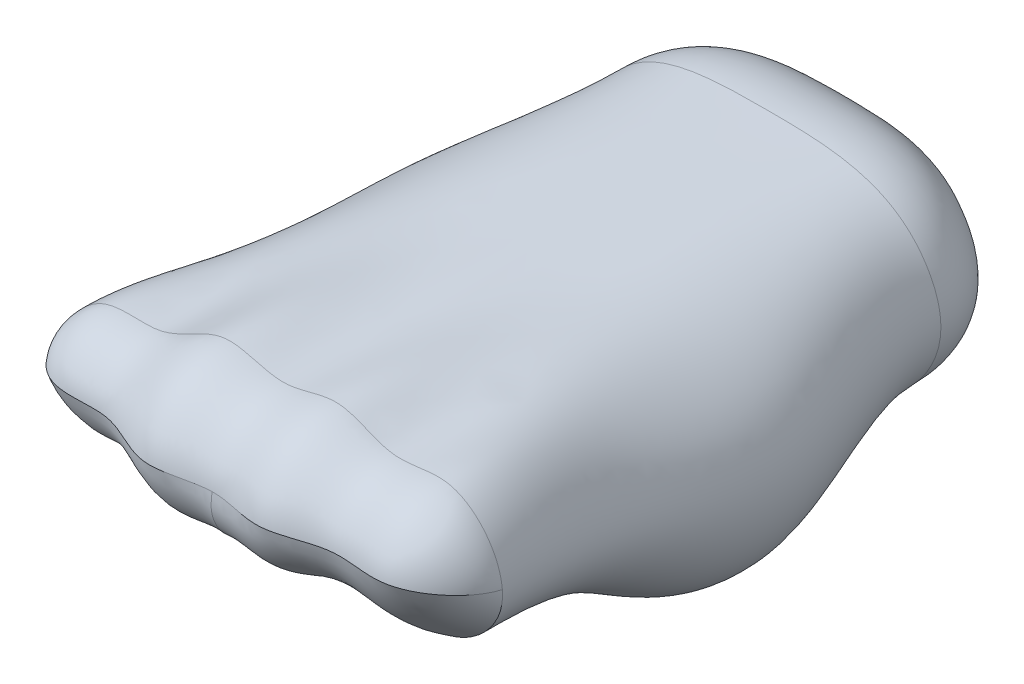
ISO-10303-21;
HEADER;
FILE_DESCRIPTION(('STEP AP214'),'2;1');
FILE_NAME('part.step','',(''),(''),'','','');
FILE_SCHEMA(('AUTOMOTIVE_DESIGN { 1 0 10303 214 1 1 1 1 }'));
ENDSEC;
DATA;
#1=APPLICATION_CONTEXT('core data for automotive mechanical design processes');
#2=APPLICATION_PROTOCOL_DEFINITION('international standard','automotive_design',2000,#1);
#3=PRODUCT_CONTEXT('',#1,'mechanical');
#4=PRODUCT('Part','Part','',(#3));
#5=PRODUCT_RELATED_PRODUCT_CATEGORY('part','',(#4));
#6=PRODUCT_DEFINITION_FORMATION('','',#4);
#7=PRODUCT_DEFINITION_CONTEXT('part definition',#1,'design');
#8=PRODUCT_DEFINITION('design','',#6,#7);
#9=PRODUCT_DEFINITION_SHAPE('','',#8);
#10=(LENGTH_UNIT() NAMED_UNIT(*) SI_UNIT(.MILLI.,.METRE.));
#11=(NAMED_UNIT(*) PLANE_ANGLE_UNIT() SI_UNIT($,.RADIAN.));
#12=(NAMED_UNIT(*) SI_UNIT($,.STERADIAN.) SOLID_ANGLE_UNIT());
#13=UNCERTAINTY_MEASURE_WITH_UNIT(LENGTH_MEASURE(1.E-05),#10,'distance_accuracy_value','');
#14=(GEOMETRIC_REPRESENTATION_CONTEXT(3) GLOBAL_UNCERTAINTY_ASSIGNED_CONTEXT((#13)) GLOBAL_UNIT_ASSIGNED_CONTEXT((#10,
#11,#12)) REPRESENTATION_CONTEXT('',''));
#15=CARTESIAN_POINT('',(0.,0.,0.));
#16=DIRECTION('',(0.,0.,1.));
#17=DIRECTION('',(1.,0.,0.));
#18=AXIS2_PLACEMENT_3D('',#15,#16,#17);
#19=CARTESIAN_POINT('',(0.,16.,0.));
#20=CARTESIAN_POINT('',(0.,16.,8.0266361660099));
#21=CARTESIAN_POINT('',(0.0122544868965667,16.1048290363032,16.5266396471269));
#22=CARTESIAN_POINT('',(0.0131684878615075,16.3239266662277,29.2763030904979));
#23=CARTESIAN_POINT('',(0.0064055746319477,16.4929268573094,37.8938040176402));
#24=CARTESIAN_POINT('',(-0.00136566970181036,16.6596457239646,46.393769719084));
#25=CARTESIAN_POINT('',(-0.00567183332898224,16.8842415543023,59.142864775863));
#26=CARTESIAN_POINT('',(0.00306355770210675,17.0000015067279,67.9995604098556));
#27=CARTESIAN_POINT('',(0.00306355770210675,17.0000015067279,76.5));
#28=CARTESIAN_POINT('',(-0.289778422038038,16.,0.));
#29=CARTESIAN_POINT('',(-0.289778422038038,16.,8.02662137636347));
#30=CARTESIAN_POINT('',(-0.296119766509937,16.1076566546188,16.5263181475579));
#31=CARTESIAN_POINT('',(-0.305935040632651,16.3263491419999,29.2764406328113));
#32=CARTESIAN_POINT('',(-0.312466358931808,16.4931273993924,37.8939653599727));
#33=CARTESIAN_POINT('',(-0.314504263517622,16.6576107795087,46.393810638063));
#34=CARTESIAN_POINT('',(-0.3110799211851,16.8811635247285,59.1427917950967));
#35=CARTESIAN_POINT('',(-0.298918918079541,16.999852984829,67.9995520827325));
#36=CARTESIAN_POINT('',(-0.298918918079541,16.999852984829,76.5));
#37=CARTESIAN_POINT('',(-0.724446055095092,15.9997179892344,0.));
#38=CARTESIAN_POINT('',(-0.724446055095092,15.9997179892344,8.02671353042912));
#39=CARTESIAN_POINT('',(-0.739943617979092,16.1126853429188,16.5260389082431));
#40=CARTESIAN_POINT('',(-0.764203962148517,16.3288171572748,29.2769708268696));
#41=CARTESIAN_POINT('',(-0.780458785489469,16.4894898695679,37.89481995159));
#42=CARTESIAN_POINT('',(-0.785685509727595,16.651967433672,46.3943931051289));
#43=CARTESIAN_POINT('',(-0.777489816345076,16.8832376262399,59.1422906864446));
#44=CARTESIAN_POINT('',(-0.74758394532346,17.0238167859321,67.9995297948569));
#45=CARTESIAN_POINT('',(-0.74758394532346,17.0238167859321,76.5));
#46=CARTESIAN_POINT('',(-1.30366114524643,15.9981816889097,0.));
#47=CARTESIAN_POINT('',(-1.30366114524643,15.9981816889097,8.02701465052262));
#48=CARTESIAN_POINT('',(-1.33084030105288,16.1200357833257,16.526096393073));
#49=CARTESIAN_POINT('',(-1.37398388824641,16.3297157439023,29.2783008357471));
#50=CARTESIAN_POINT('',(-1.40313160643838,16.4778450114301,37.8966101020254));
#51=CARTESIAN_POINT('',(-1.4128126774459,16.6398916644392,46.3956274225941));
#52=CARTESIAN_POINT('',(-1.39874602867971,16.8963227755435,59.1418580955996));
#53=CARTESIAN_POINT('',(-1.34578832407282,17.0939122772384,67.9994014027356));
#54=CARTESIAN_POINT('',(-1.34578832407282,17.0939122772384,76.5));
#55=CARTESIAN_POINT('',(-3.90859115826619,15.9868930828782,0.));
#56=CARTESIAN_POINT('',(-3.90859115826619,15.9868930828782,8.0289351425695));
#57=CARTESIAN_POINT('',(-3.98703473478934,16.1532730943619,16.5276410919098));
#58=CARTESIAN_POINT('',(-4.11429061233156,16.3259927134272,29.2861284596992));
#59=CARTESIAN_POINT('',(-4.20135377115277,16.406298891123,37.9065775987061));
#60=CARTESIAN_POINT('',(-4.23159515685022,16.5726664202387,46.4025262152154));
#61=CARTESIAN_POINT('',(-4.19222252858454,16.9816030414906,59.1406322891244));
#62=CARTESIAN_POINT('',(-4.03677761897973,17.5084359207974,67.9985911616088));
#63=CARTESIAN_POINT('',(-4.03677761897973,17.5084359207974,76.5));
#64=CARTESIAN_POINT('',(-9.99957443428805,15.8548791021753,0.));
#65=CARTESIAN_POINT('',(-9.99957443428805,15.8548791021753,8.04489836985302));
#66=CARTESIAN_POINT('',(-10.1781773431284,16.1991810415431,16.5569540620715));
#67=CARTESIAN_POINT('',(-10.4915473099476,16.1500124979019,29.3408833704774));
#68=CARTESIAN_POINT('',(-10.7151469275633,15.8796363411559,37.9675621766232));
#69=CARTESIAN_POINT('',(-10.8022661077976,16.1720158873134,46.4449492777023));
#70=CARTESIAN_POINT('',(-10.7184119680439,17.619252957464,59.1528156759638));
#71=CARTESIAN_POINT('',(-10.3350803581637,20.1601133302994,67.9691661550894));
#72=CARTESIAN_POINT('',(-10.3350803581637,20.1601133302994,76.5));
#73=CARTESIAN_POINT('',(-16.5016847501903,14.5926964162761,0.));
#74=CARTESIAN_POINT('',(-16.5016847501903,14.5926964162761,8.08784574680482));
#75=CARTESIAN_POINT('',(-16.9899599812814,14.5518536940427,16.6613819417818));
#76=CARTESIAN_POINT('',(-17.7291311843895,14.9373273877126,29.4828744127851));
#77=CARTESIAN_POINT('',(-18.2142190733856,15.3770253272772,38.1079643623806));
#78=CARTESIAN_POINT('',(-18.3081143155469,15.7174397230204,46.5430487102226));
#79=CARTESIAN_POINT('',(-17.8897965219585,15.4641163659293,59.2207070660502));
#80=CARTESIAN_POINT('',(-16.7557272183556,14.0909378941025,68.0334377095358));
#81=CARTESIAN_POINT('',(-16.7557272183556,14.0909378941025,76.5));
#82=CARTESIAN_POINT('',(-20.3161620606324,12.3591897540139,0.));
#83=CARTESIAN_POINT('',(-20.3161620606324,12.3591897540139,8.1469617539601));
#84=CARTESIAN_POINT('',(-21.4740802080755,12.3755574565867,16.7566398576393));
#85=CARTESIAN_POINT('',(-22.6786182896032,12.4756791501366,29.6110281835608));
#86=CARTESIAN_POINT('',(-23.2401912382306,12.5728372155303,38.2510540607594));
#87=CARTESIAN_POINT('',(-23.2807689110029,13.0857997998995,46.6488141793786));
#88=CARTESIAN_POINT('',(-22.8796552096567,13.7800631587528,59.252126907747));
#89=CARTESIAN_POINT('',(-21.9244152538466,14.1003174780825,68.057359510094));
#90=CARTESIAN_POINT('',(-21.9244152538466,14.1003174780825,76.5));
#91=CARTESIAN_POINT('',(-21.6792259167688,11.342289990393,0.));
#92=CARTESIAN_POINT('',(-21.6792259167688,11.342289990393,8.17475870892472));
#93=CARTESIAN_POINT('',(-23.1450685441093,11.3908329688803,16.7955400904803));
#94=CARTESIAN_POINT('',(-24.5548646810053,11.3525092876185,29.6620521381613));
#95=CARTESIAN_POINT('',(-25.1422309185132,11.2806837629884,38.308339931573));
#96=CARTESIAN_POINT('',(-25.1530046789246,11.86130062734,46.6913218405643));
#97=CARTESIAN_POINT('',(-24.7620530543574,12.9965891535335,59.2645581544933));
#98=CARTESIAN_POINT('',(-23.9062817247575,14.135317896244,68.0482149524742));
#99=CARTESIAN_POINT('',(-23.9062817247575,14.135317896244,76.5));
#100=CARTESIAN_POINT('',(-22.8386416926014,10.3556376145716,0.));
#101=CARTESIAN_POINT('',(-22.8386416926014,10.3556376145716,8.20226648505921));
#102=CARTESIAN_POINT('',(-24.6064149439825,10.4346697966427,16.8313227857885));
#103=CARTESIAN_POINT('',(-26.2101107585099,10.2631494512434,29.7082685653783));
#104=CARTESIAN_POINT('',(-26.8148625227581,10.029041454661,38.3602972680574));
#105=CARTESIAN_POINT('',(-26.7911186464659,10.6714713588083,46.7299409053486));
#106=CARTESIAN_POINT('',(-26.4095189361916,12.2259311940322,59.2759605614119));
#107=CARTESIAN_POINT('',(-25.6621724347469,14.1485617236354,68.0301883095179));
#108=CARTESIAN_POINT('',(-25.6621724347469,14.1485617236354,76.5));
#109=CARTESIAN_POINT('',(-25.8254416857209,7.05720288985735,0.));
#110=CARTESIAN_POINT('',(-25.8254416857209,7.05720288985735,8.29343359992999));
#111=CARTESIAN_POINT('',(-28.5119697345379,7.25920025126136,16.9402343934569));
#112=CARTESIAN_POINT('',(-30.6668765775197,6.74923827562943,29.8431669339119));
#113=CARTESIAN_POINT('',(-31.2828576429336,6.07403345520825,38.510869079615));
#114=CARTESIAN_POINT('',(-31.1413605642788,6.86818199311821,46.8420646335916));
#115=CARTESIAN_POINT('',(-30.8305510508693,9.5106633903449,59.3130163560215));
#116=CARTESIAN_POINT('',(-30.5366135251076,13.4875790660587,67.9282768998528));
#117=CARTESIAN_POINT('',(-30.5366135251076,13.4875790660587,76.5));
#118=CARTESIAN_POINT('',(-27.4789195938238,3.13022859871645,0.));
#119=CARTESIAN_POINT('',(-27.4789195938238,3.13022859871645,8.39656058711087));
#120=CARTESIAN_POINT('',(-30.9214154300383,3.3494496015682,17.0500973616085));
#121=CARTESIAN_POINT('',(-33.4231827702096,2.83044792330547,29.9728510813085));
#122=CARTESIAN_POINT('',(-33.9338538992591,2.13465251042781,38.6466437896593));
#123=CARTESIAN_POINT('',(-33.7076030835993,2.92834272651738,46.9429594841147));
#124=CARTESIAN_POINT('',(-33.7126820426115,5.3463770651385,59.3630724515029));
#125=CARTESIAN_POINT('',(-34.3360790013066,8.81182343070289,67.9763010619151));
#126=CARTESIAN_POINT('',(-34.3360790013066,8.81182343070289,76.5));
#127=CARTESIAN_POINT('',(-27.5002605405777,0.0125683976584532,0.));
#128=CARTESIAN_POINT('',(-27.5002605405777,0.0125683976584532,8.42432225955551));
#129=CARTESIAN_POINT('',(-30.9016000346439,0.280621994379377,17.1228682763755));
#130=CARTESIAN_POINT('',(-33.3939849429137,-0.324879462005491,30.0816836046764));
#131=CARTESIAN_POINT('',(-33.92059101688,-1.14441060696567,38.7617473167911));
#132=CARTESIAN_POINT('',(-33.7520067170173,-0.402519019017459,47.0243800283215));
#133=CARTESIAN_POINT('',(-33.8793361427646,1.90795465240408,59.4000919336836));
#134=CARTESIAN_POINT('',(-34.6397850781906,5.24421987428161,68.007856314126));
#135=CARTESIAN_POINT('',(-34.6397850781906,5.24421987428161,76.5));
#136=CARTESIAN_POINT('',(-27.4998041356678,-0.0761238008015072,0.));
#137=CARTESIAN_POINT('',(-27.4998041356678,-0.0761238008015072,8.42507155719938));
#138=CARTESIAN_POINT('',(-30.8994740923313,0.19335066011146,17.1249264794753));
#139=CARTESIAN_POINT('',(-33.3913633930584,-0.414679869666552,30.0847848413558));
#140=CARTESIAN_POINT('',(-33.9184924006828,-1.23782442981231,38.7650281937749));
#141=CARTESIAN_POINT('',(-33.7516324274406,-0.497449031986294,47.0266975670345));
#142=CARTESIAN_POINT('',(-33.8823147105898,1.81003253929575,59.4011428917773));
#143=CARTESIAN_POINT('',(-34.6461781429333,5.14287286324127,68.0087393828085));
#144=CARTESIAN_POINT('',(-34.6461781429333,5.14287286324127,76.5));
#145=CARTESIAN_POINT('',(-27.4941032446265,-0.631798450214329,0.));
#146=CARTESIAN_POINT('',(-27.4941032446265,-0.631798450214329,8.42965181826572));
#147=CARTESIAN_POINT('',(-30.881997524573,-0.353330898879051,17.1377900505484));
#148=CARTESIAN_POINT('',(-33.370158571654,-0.97739736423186,30.1042286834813));
#149=CARTESIAN_POINT('',(-33.9007262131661,-1.82344310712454,38.7856010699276));
#150=CARTESIAN_POINT('',(-33.7448626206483,-1.09268273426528,47.0412211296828));
#151=CARTESIAN_POINT('',(-33.8961787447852,1.19625558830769,59.4077216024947));
#152=CARTESIAN_POINT('',(-34.6801264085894,4.50835918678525,68.0142245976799));
#153=CARTESIAN_POINT('',(-34.6801264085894,4.50835918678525,76.5));
#154=CARTESIAN_POINT('',(-27.4527983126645,-1.14919781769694,0.));
#155=CARTESIAN_POINT('',(-27.4527983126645,-1.14919781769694,8.43246931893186));
#156=CARTESIAN_POINT('',(-30.8130601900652,-0.861202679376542,17.1493686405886));
#157=CARTESIAN_POINT('',(-33.2898551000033,-1.50261738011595,30.1225101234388));
#158=CARTESIAN_POINT('',(-33.8256812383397,-2.37331111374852,38.8049787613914));
#159=CARTESIAN_POINT('',(-33.682503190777,-1.65297031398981,47.0547913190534));
#160=CARTESIAN_POINT('',(-33.8483129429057,0.621272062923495,59.4137742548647));
#161=CARTESIAN_POINT('',(-34.6343873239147,3.92320077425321,68.0187316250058));
#162=CARTESIAN_POINT('',(-34.6343873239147,3.92320077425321,76.5));
#163=CARTESIAN_POINT('',(-26.8937879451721,-5.02568689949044,0.));
#164=CARTESIAN_POINT('',(-26.8937879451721,-5.02568689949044,8.44619625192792));
#165=CARTESIAN_POINT('',(-29.9303548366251,-4.65594649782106,17.2338955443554));
#166=CARTESIAN_POINT('',(-32.2837855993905,-5.44627589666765,30.2611281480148));
#167=CARTESIAN_POINT('',(-32.891715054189,-6.52852025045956,38.9522552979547));
#168=CARTESIAN_POINT('',(-32.8543858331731,-5.88985991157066,47.1573061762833));
#169=CARTESIAN_POINT('',(-33.0414361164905,-3.68069499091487,59.4585437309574));
#170=CARTESIAN_POINT('',(-33.6213904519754,-0.346393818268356,68.049234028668));
#171=CARTESIAN_POINT('',(-33.6213904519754,-0.346393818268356,76.5));
#172=CARTESIAN_POINT('',(-24.9314910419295,-8.37891743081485,0.));
#173=CARTESIAN_POINT('',(-24.9314910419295,-8.37891743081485,8.41432302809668));
#174=CARTESIAN_POINT('',(-26.9967171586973,-7.87706202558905,17.2938405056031));
#175=CARTESIAN_POINT('',(-29.0170339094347,-8.90842364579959,30.3908054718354));
#176=CARTESIAN_POINT('',(-29.8811391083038,-10.3329575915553,39.0920600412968));
#177=CARTESIAN_POINT('',(-29.9994019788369,-9.78637013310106,47.2509817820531));
#178=CARTESIAN_POINT('',(-29.6872102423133,-7.36666934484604,59.4938417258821));
#179=CARTESIAN_POINT('',(-28.773019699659,-3.36079190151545,68.0562690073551));
#180=CARTESIAN_POINT('',(-28.773019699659,-3.36079190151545,76.5));
#181=CARTESIAN_POINT('',(-22.1792239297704,-10.9117452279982,0.));
#182=CARTESIAN_POINT('',(-22.1792239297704,-10.9117452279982,8.41380822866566));
#183=CARTESIAN_POINT('',(-23.4320862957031,-10.2274129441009,17.337573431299));
#184=CARTESIAN_POINT('',(-24.9863791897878,-11.5249777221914,30.523648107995));
#185=CARTESIAN_POINT('',(-25.8634870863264,-13.3506540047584,39.2792631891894));
#186=CARTESIAN_POINT('',(-26.1007602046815,-12.6161430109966,47.3872057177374));
#187=CARTESIAN_POINT('',(-25.7263632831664,-9.00258748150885,59.4501212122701));
#188=CARTESIAN_POINT('',(-24.3776595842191,-2.78717335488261,67.7582723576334));
#189=CARTESIAN_POINT('',(-24.3776595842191,-2.78717335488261,76.5));
#190=CARTESIAN_POINT('',(-21.5983569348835,-11.4038987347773,0.));
#191=CARTESIAN_POINT('',(-21.5983569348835,-11.4038987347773,8.41427534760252));
#192=CARTESIAN_POINT('',(-22.6921416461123,-10.680145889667,17.3459806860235));
#193=CARTESIAN_POINT('',(-24.1485370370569,-12.0317578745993,30.5507194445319));
#194=CARTESIAN_POINT('',(-25.0210612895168,-13.9403772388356,39.3186603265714));
#195=CARTESIAN_POINT('',(-25.2812796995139,-13.1597618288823,47.4160955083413));
#196=CARTESIAN_POINT('',(-24.9073938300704,-9.27578105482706,59.4389704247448));
#197=CARTESIAN_POINT('',(-23.5026307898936,-2.56781335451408,67.6880001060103));
#198=CARTESIAN_POINT('',(-23.5026307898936,-2.56781335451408,76.5));
#199=CARTESIAN_POINT('',(-19.8255964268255,-12.7319573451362,0.));
#200=CARTESIAN_POINT('',(-19.8255964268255,-12.7319573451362,8.41852624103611));
#201=CARTESIAN_POINT('',(-20.4968267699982,-11.8840067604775,17.3691105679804));
#202=CARTESIAN_POINT('',(-21.6677092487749,-13.3701343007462,30.6288103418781));
#203=CARTESIAN_POINT('',(-22.500710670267,-15.5016718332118,39.4357760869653));
#204=CARTESIAN_POINT('',(-22.8175713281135,-14.5554675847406,47.5025906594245));
#205=CARTESIAN_POINT('',(-22.4849404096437,-9.81941037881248,59.4007226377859));
#206=CARTESIAN_POINT('',(-21.0298686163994,-1.60579520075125,67.453130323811));
#207=CARTESIAN_POINT('',(-21.0298686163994,-1.60579520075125,76.5));
#208=CARTESIAN_POINT('',(-15.5112505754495,-14.890213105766,0.));
#209=CARTESIAN_POINT('',(-15.5112505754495,-14.890213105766,8.44356524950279));
#210=CARTESIAN_POINT('',(-15.5035085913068,-13.8490674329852,17.4165956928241));
#211=CARTESIAN_POINT('',(-16.1247060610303,-15.3302105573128,30.7863636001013));
#212=CARTESIAN_POINT('',(-16.7965849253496,-17.5784868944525,39.6804280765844));
#213=CARTESIAN_POINT('',(-17.2141023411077,-16.0076897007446,47.6853632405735));
#214=CARTESIAN_POINT('',(-17.1652180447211,-9.35266783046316,59.3097689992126));
#215=CARTESIAN_POINT('',(-16.0900721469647,1.66875453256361,66.8871375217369));
#216=CARTESIAN_POINT('',(-16.0900721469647,1.66875453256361,76.5));
#217=CARTESIAN_POINT('',(-8.88418513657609,-15.8945657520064,0.));
#218=CARTESIAN_POINT('',(-8.88418513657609,-15.8945657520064,8.48646342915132));
#219=CARTESIAN_POINT('',(-8.53404229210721,-15.8587341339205,17.5750188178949));
#220=CARTESIAN_POINT('',(-8.82008248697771,-15.7778220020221,30.8886641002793));
#221=CARTESIAN_POINT('',(-9.34848142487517,-15.7135897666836,39.6442183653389));
#222=CARTESIAN_POINT('',(-9.72230481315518,-13.1165601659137,47.6386315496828));
#223=CARTESIAN_POINT('',(-9.65334119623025,-8.59629275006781,59.6080707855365));
#224=CARTESIAN_POINT('',(-8.62592176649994,-4.73202687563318,68.0714675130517));
#225=CARTESIAN_POINT('',(-8.62592176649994,-4.73202687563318,76.5));
#226=CARTESIAN_POINT('',(-3.44392560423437,-15.9903791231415,0.));
#227=CARTESIAN_POINT('',(-3.44392560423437,-15.9903791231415,8.50074535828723));
#228=CARTESIAN_POINT('',(-3.2507997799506,-16.8088574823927,17.5987008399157));
#229=CARTESIAN_POINT('',(-3.35677258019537,-16.7882378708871,30.9314661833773));
#230=CARTESIAN_POINT('',(-3.59260354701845,-16.2488567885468,39.7136009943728));
#231=CARTESIAN_POINT('',(-3.77125689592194,-12.5575058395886,47.691784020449));
#232=CARTESIAN_POINT('',(-3.75803158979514,-6.16807606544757,59.5840000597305));
#233=CARTESIAN_POINT('',(-3.31019337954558,-0.710557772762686,67.7327470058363));
#234=CARTESIAN_POINT('',(-3.31019337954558,-0.710557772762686,76.5));
#235=CARTESIAN_POINT('',(-1.14852037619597,-15.9986439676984,0.));
#236=CARTESIAN_POINT('',(-1.14852037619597,-15.9986439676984,8.51299446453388));
#237=CARTESIAN_POINT('',(-1.07956433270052,-17.373048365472,17.5982477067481));
#238=CARTESIAN_POINT('',(-1.11458957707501,-17.4598607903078,30.9381623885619));
#239=CARTESIAN_POINT('',(-1.19577367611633,-16.6845103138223,39.7348906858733));
#240=CARTESIAN_POINT('',(-1.25815343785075,-12.585279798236,47.7103381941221));
#241=CARTESIAN_POINT('',(-1.25503744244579,-5.70784887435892,59.5597504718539));
#242=CARTESIAN_POINT('',(-1.10196455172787,-0.125100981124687,67.6797056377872));
#243=CARTESIAN_POINT('',(-1.10196455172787,-0.125100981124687,76.5));
#244=CARTESIAN_POINT('',(-0.638196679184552,-15.9997811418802,0.));
#245=CARTESIAN_POINT('',(-0.638196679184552,-15.9997811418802,8.51592402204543));
#246=CARTESIAN_POINT('',(-0.59833542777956,-17.5031834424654,17.5978849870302));
#247=CARTESIAN_POINT('',(-0.61770172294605,-17.6158000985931,30.9393476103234));
#248=CARTESIAN_POINT('',(-0.663686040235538,-16.7866350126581,39.7393773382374));
#249=CARTESIAN_POINT('',(-0.699317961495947,-12.5982789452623,47.7143315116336));
#250=CARTESIAN_POINT('',(-0.698059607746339,-5.62161788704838,59.5540410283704));
#251=CARTESIAN_POINT('',(-0.611769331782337,-0.0281129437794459,67.6706206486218));
#252=CARTESIAN_POINT('',(-0.611769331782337,-0.0281129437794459,76.5));
#253=CARTESIAN_POINT('',(-0.255278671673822,-16.,0.));
#254=CARTESIAN_POINT('',(-0.255278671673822,-16.,8.51850985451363));
#255=CARTESIAN_POINT('',(-0.238903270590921,-17.6066289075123,17.5973268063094));
#256=CARTESIAN_POINT('',(-0.246630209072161,-17.7405268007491,30.9398876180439));
#257=CARTESIAN_POINT('',(-0.265275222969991,-16.8689770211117,39.7424220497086));
#258=CARTESIAN_POINT('',(-0.279810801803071,-12.6156708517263,47.7171455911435));
#259=CARTESIAN_POINT('',(-0.279461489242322,-5.57659763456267,59.5494516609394));
#260=CARTESIAN_POINT('',(-0.24462191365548,0.00254955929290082,67.6673905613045));
#261=CARTESIAN_POINT('',(-0.24462191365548,0.00254955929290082,76.5));
#262=CARTESIAN_POINT('',(0.751418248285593,-16.,0.));
#263=CARTESIAN_POINT('',(0.751418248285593,-16.,8.52641821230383));
#264=CARTESIAN_POINT('',(0.762395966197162,-17.908877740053,17.6056090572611));
#265=CARTESIAN_POINT('',(0.788978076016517,-18.1047663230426,30.9363705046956));
#266=CARTESIAN_POINT('',(0.810582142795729,-17.1087689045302,39.7349704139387));
#267=CARTESIAN_POINT('',(0.815535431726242,-12.6777277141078,47.7127349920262));
#268=CARTESIAN_POINT('',(0.793995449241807,-5.49245438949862,59.5573209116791));
#269=CARTESIAN_POINT('',(0.734961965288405,-0.00766010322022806,67.6676777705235));
#270=CARTESIAN_POINT('',(0.734961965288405,-0.00766010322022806,76.5));
#271=CARTESIAN_POINT('',(3.25240984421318,-15.9957923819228,0.));
#272=CARTESIAN_POINT('',(3.25240984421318,-15.9957923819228,8.55418374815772));
#273=CARTESIAN_POINT('',(3.27590900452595,-18.7817996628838,17.6313811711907));
#274=CARTESIAN_POINT('',(3.38929536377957,-19.1515598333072,30.9193169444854));
#275=CARTESIAN_POINT('',(3.49618907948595,-17.7879436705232,39.6987450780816));
#276=CARTESIAN_POINT('',(3.53312976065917,-12.9242358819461,47.6889918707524));
#277=CARTESIAN_POINT('',(3.44889881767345,-5.56708753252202,59.5913667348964));
#278=CARTESIAN_POINT('',(3.17688373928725,-0.723922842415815,67.7325910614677));
#279=CARTESIAN_POINT('',(3.17688373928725,-0.723922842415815,76.5));
#280=CARTESIAN_POINT('',(8.21038516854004,-15.8825868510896,0.));
#281=CARTESIAN_POINT('',(8.21038516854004,-15.8825868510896,8.63947093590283));
#282=CARTESIAN_POINT('',(8.70028694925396,-20.3391058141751,17.6520756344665));
#283=CARTESIAN_POINT('',(9.08400245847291,-21.1914550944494,30.8596962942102));
#284=CARTESIAN_POINT('',(9.18640591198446,-19.2903115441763,39.6162597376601));
#285=CARTESIAN_POINT('',(9.04310540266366,-13.961497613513,47.6392121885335));
#286=CARTESIAN_POINT('',(8.65311394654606,-6.97953667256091,59.6126720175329));
#287=CARTESIAN_POINT('',(8.1310066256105,-4.08513120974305,67.9917808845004));
#288=CARTESIAN_POINT('',(8.1310066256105,-4.08513120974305,76.5));
#289=CARTESIAN_POINT('',(14.2803134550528,-15.1154549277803,0.));
#290=CARTESIAN_POINT('',(14.2803134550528,-15.1154549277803,8.78197627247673));
#291=CARTESIAN_POINT('',(15.9883751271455,-20.4764506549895,17.5682680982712));
#292=CARTESIAN_POINT('',(16.8137751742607,-22.971600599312,30.7569215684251));
#293=CARTESIAN_POINT('',(16.6205975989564,-22.2627607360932,39.6156551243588));
#294=CARTESIAN_POINT('',(15.9785698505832,-16.7713642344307,47.6663869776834));
#295=CARTESIAN_POINT('',(15.2543011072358,-7.22622745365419,59.3887577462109));
#296=CARTESIAN_POINT('',(15.175208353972,0.97393622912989,67.0646998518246));
#297=CARTESIAN_POINT('',(15.175208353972,0.97393622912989,76.5));
#298=CARTESIAN_POINT('',(18.4390627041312,-13.5076089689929,0.));
#299=CARTESIAN_POINT('',(18.4390627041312,-13.5076089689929,8.84238869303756));
#300=CARTESIAN_POINT('',(21.0419264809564,-19.2725599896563,17.5397715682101));
#301=CARTESIAN_POINT('',(22.3567116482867,-21.8721992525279,30.6160640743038));
#302=CARTESIAN_POINT('',(22.1235172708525,-21.0202690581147,39.389836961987));
#303=CARTESIAN_POINT('',(21.1324680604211,-16.1083361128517,47.4998155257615));
#304=CARTESIAN_POINT('',(19.8725648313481,-8.53803719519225,59.4831527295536));
#305=CARTESIAN_POINT('',(19.4343666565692,-3.38168972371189,67.6345077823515));
#306=CARTESIAN_POINT('',(19.4343666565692,-3.38168972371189,76.5));
#307=CARTESIAN_POINT('',(20.5161597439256,-12.1895533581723,0.));
#308=CARTESIAN_POINT('',(20.5161597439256,-12.1895533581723,8.82836402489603));
#309=CARTESIAN_POINT('',(23.5288292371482,-17.7875014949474,17.5080136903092));
#310=CARTESIAN_POINT('',(25.0664302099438,-20.2793377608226,30.5346052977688));
#311=CARTESIAN_POINT('',(24.8134966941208,-19.4171966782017,39.2724165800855));
#312=CARTESIAN_POINT('',(23.7414958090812,-14.9110315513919,47.4125327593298));
#313=CARTESIAN_POINT('',(22.4756828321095,-8.35043475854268,59.5138204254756));
#314=CARTESIAN_POINT('',(22.2222497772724,-4.48594823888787,67.8283058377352));
#315=CARTESIAN_POINT('',(22.2222497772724,-4.48594823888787,76.5));
#316=CARTESIAN_POINT('',(21.4481843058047,-11.5339385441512,0.));
#317=CARTESIAN_POINT('',(21.4481843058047,-11.5339385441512,8.81758585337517));
#318=CARTESIAN_POINT('',(24.6396936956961,-17.0175348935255,17.4912230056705));
#319=CARTESIAN_POINT('',(26.2734768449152,-19.4463012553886,30.4969166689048));
#320=CARTESIAN_POINT('',(26.0107963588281,-18.5887065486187,39.2202032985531));
#321=CARTESIAN_POINT('',(24.9149626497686,-14.2713174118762,47.3737745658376));
#322=CARTESIAN_POINT('',(23.6832409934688,-8.14374871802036,59.5240282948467));
#323=CARTESIAN_POINT('',(23.5652984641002,-4.79771573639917,67.9030596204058));
#324=CARTESIAN_POINT('',(23.5652984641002,-4.79771573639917,76.5));
#325=CARTESIAN_POINT('',(24.636459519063,-8.87835954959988,0.));
#326=CARTESIAN_POINT('',(24.636459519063,-8.87835954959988,8.7562851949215));
#327=CARTESIAN_POINT('',(28.3955068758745,-13.775408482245,17.418202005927));
#328=CARTESIAN_POINT('',(30.3414494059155,-15.8888607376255,30.3609021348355));
#329=CARTESIAN_POINT('',(30.0552792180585,-15.0633815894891,39.0435812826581));
#330=CARTESIAN_POINT('',(28.9588298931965,-11.4031146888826,47.2429383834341));
#331=CARTESIAN_POINT('',(28.0459632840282,-6.64314137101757,59.5382664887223));
#332=CARTESIAN_POINT('',(28.6523649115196,-4.78561453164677,68.0974420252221));
#333=CARTESIAN_POINT('',(28.6523649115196,-4.78561453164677,76.5));
#334=CARTESIAN_POINT('',(27.1784771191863,-4.53980603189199,0.));
#335=CARTESIAN_POINT('',(27.1784771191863,-4.53980603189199,8.62958946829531));
#336=CARTESIAN_POINT('',(31.1123004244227,-8.3511527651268,17.2846930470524));
#337=CARTESIAN_POINT('',(33.1694404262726,-9.94276769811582,30.2168849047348));
#338=CARTESIAN_POINT('',(32.8922135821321,-9.24310137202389,38.9015732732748));
#339=CARTESIAN_POINT('',(32.0970636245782,-6.14567938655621,47.1376509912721));
#340=CARTESIAN_POINT('',(32.1555787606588,-1.99584884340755,59.4643321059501));
#341=CARTESIAN_POINT('',(34.2270344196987,-0.146799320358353,68.0342433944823));
#342=CARTESIAN_POINT('',(34.2270344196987,-0.146799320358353,76.5));
#343=CARTESIAN_POINT('',(27.4970479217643,-0.601718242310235,0.));
#344=CARTESIAN_POINT('',(27.4970479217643,-0.601718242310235,8.54532825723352));
#345=CARTESIAN_POINT('',(31.5161793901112,-3.53644233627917,17.170954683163));
#346=CARTESIAN_POINT('',(33.6012244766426,-4.80555385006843,30.0886631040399));
#347=CARTESIAN_POINT('',(33.3000486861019,-4.3135983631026,38.7708105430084));
#348=CARTESIAN_POINT('',(32.4799639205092,-1.65745271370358,47.0407180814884));
#349=CARTESIAN_POINT('',(32.5513176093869,2.26650176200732,59.4070196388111));
#350=CARTESIAN_POINT('',(34.7111980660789,4.67200978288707,67.978490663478));
#351=CARTESIAN_POINT('',(34.7111980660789,4.67200978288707,76.5));
#352=CARTESIAN_POINT('',(27.5,-0.0387881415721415,0.));
#353=CARTESIAN_POINT('',(27.5,-0.0387881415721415,8.53384375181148));
#354=CARTESIAN_POINT('',(31.5324017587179,-2.85114004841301,17.1548465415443));
#355=CARTESIAN_POINT('',(33.6182722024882,-4.07757189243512,30.0702785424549));
#356=CARTESIAN_POINT('',(33.3095963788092,-3.61712452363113,38.7519631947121));
#357=CARTESIAN_POINT('',(32.4789618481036,-1.02334836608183,47.0267605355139));
#358=CARTESIAN_POINT('',(32.5395905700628,2.87251706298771,59.3990189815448));
#359=CARTESIAN_POINT('',(34.7004040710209,5.36517919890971,67.9703388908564));
#360=CARTESIAN_POINT('',(34.7004040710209,5.36517919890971,76.5));
#361=CARTESIAN_POINT('',(27.5,0.979891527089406,0.));
#362=CARTESIAN_POINT('',(27.5,0.979891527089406,8.51314301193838));
#363=CARTESIAN_POINT('',(31.5565453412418,-1.61139795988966,17.125715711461));
#364=CARTESIAN_POINT('',(33.6435381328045,-2.76101440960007,30.037001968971));
#365=CARTESIAN_POINT('',(33.3208097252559,-2.35779106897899,38.7178365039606));
#366=CARTESIAN_POINT('',(32.4702441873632,0.123216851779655,47.0014894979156));
#367=CARTESIAN_POINT('',(32.5099356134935,3.96875341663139,59.384565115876));
#368=CARTESIAN_POINT('',(34.670987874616,6.62001170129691,67.9555475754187));
#369=CARTESIAN_POINT('',(34.670987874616,6.62001170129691,76.5));
#370=CARTESIAN_POINT('',(27.3701833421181,1.95978305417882,0.));
#371=CARTESIAN_POINT('',(27.3701833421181,1.95978305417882,8.49521461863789));
#372=CARTESIAN_POINT('',(31.4531031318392,-0.428158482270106,17.0981437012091));
#373=CARTESIAN_POINT('',(33.532154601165,-1.51403822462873,30.0048022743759));
#374=CARTESIAN_POINT('',(33.1842320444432,-1.17088688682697,38.6845114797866));
#375=CARTESIAN_POINT('',(32.2940787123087,1.20397336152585,46.9768543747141));
#376=CARTESIAN_POINT('',(32.2764652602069,5.01327555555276,59.3712483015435));
#377=CARTESIAN_POINT('',(34.4025189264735,7.83852079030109,67.9403511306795));
#378=CARTESIAN_POINT('',(34.4025189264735,7.83852079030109,76.5));
#379=CARTESIAN_POINT('',(26.4198861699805,5.78790068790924,0.));
#380=CARTESIAN_POINT('',(26.4198861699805,5.78790068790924,8.42013822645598));
#381=CARTESIAN_POINT('',(30.4901492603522,4.1159326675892,16.9907836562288));
#382=CARTESIAN_POINT('',(32.4833256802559,3.25846040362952,29.8765284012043));
#383=CARTESIAN_POINT('',(32.0511966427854,3.39439213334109,38.5504864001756));
#384=CARTESIAN_POINT('',(31.0193473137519,5.38218022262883,46.8779166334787));
#385=CARTESIAN_POINT('',(30.7331539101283,9.0452539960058,59.320940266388));
#386=CARTESIAN_POINT('',(32.590189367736,12.4740951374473,67.8916732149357));
#387=CARTESIAN_POINT('',(32.590189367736,12.4740951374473,76.5));
#388=CARTESIAN_POINT('',(24.7206938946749,8.50950975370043,0.));
#389=CARTESIAN_POINT('',(24.7206938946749,8.50950975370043,8.35513038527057));
#390=CARTESIAN_POINT('',(28.5147311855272,7.16538244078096,16.9152753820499));
#391=CARTESIAN_POINT('',(30.32016016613,6.42273571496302,29.7796031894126));
#392=CARTESIAN_POINT('',(29.8610070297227,6.47477622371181,38.4463427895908));
#393=CARTESIAN_POINT('',(28.7583550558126,8.25115323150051,46.8013486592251));
#394=CARTESIAN_POINT('',(28.1779467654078,11.7994730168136,59.2891382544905));
#395=CARTESIAN_POINT('',(29.5381599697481,15.4816329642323,67.8817564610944));
#396=CARTESIAN_POINT('',(29.5381599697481,15.4816329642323,76.5));
#397=CARTESIAN_POINT('',(22.2041173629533,10.8978875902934,0.));
#398=CARTESIAN_POINT('',(22.2041173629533,10.8978875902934,8.27554530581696));
#399=CARTESIAN_POINT('',(25.487469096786,9.86786690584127,16.8364179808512));
#400=CARTESIAN_POINT('',(27.0076983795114,9.44020775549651,29.6722997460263));
#401=CARTESIAN_POINT('',(26.5650536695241,9.63195245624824,38.3255259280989));
#402=CARTESIAN_POINT('',(25.4985467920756,11.0841483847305,46.7124587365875));
#403=CARTESIAN_POINT('',(24.7469324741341,13.7591095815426,59.2634488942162));
#404=CARTESIAN_POINT('',(25.630031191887,16.2709663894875,67.9652463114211));
#405=CARTESIAN_POINT('',(25.630031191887,16.2709663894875,76.5));
#406=CARTESIAN_POINT('',(21.3512644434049,11.6190787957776,0.));
#407=CARTESIAN_POINT('',(21.3512644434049,11.6190787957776,8.2497045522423));
#408=CARTESIAN_POINT('',(24.4560349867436,10.6868758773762,16.8114401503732));
#409=CARTESIAN_POINT('',(25.8793140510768,10.3734673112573,29.6378710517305));
#410=CARTESIAN_POINT('',(25.4454281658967,10.6260676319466,38.2863823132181));
#411=CARTESIAN_POINT('',(24.3987862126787,11.9677691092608,46.6836330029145));
#412=CARTESIAN_POINT('',(23.6032112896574,14.3104635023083,59.2559106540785));
#413=CARTESIAN_POINT('',(24.3380852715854,16.3461132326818,67.99579189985));
#414=CARTESIAN_POINT('',(24.3380852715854,16.3461132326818,76.5));
#415=CARTESIAN_POINT('',(19.29889774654,13.0248447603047,0.));
#416=CARTESIAN_POINT('',(19.29889774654,13.0248447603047,8.1949063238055));
#417=CARTESIAN_POINT('',(21.9726585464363,12.2957329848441,16.7578111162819));
#418=CARTESIAN_POINT('',(23.1831382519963,12.2406589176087,29.5630573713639));
#419=CARTESIAN_POINT('',(22.7931462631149,12.6422912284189,38.2006316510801));
#420=CARTESIAN_POINT('',(21.8240986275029,13.723063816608,46.6202940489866));
#421=CARTESIAN_POINT('',(20.9674235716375,15.2438289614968,59.2411935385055));
#422=CARTESIAN_POINT('',(21.375895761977,16.0706559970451,68.049112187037));
#423=CARTESIAN_POINT('',(21.375895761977,16.0706559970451,76.5));
#424=CARTESIAN_POINT('',(15.2445927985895,14.8670370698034,0.));
#425=CARTESIAN_POINT('',(15.2445927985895,14.8670370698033,8.11514847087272));
#426=CARTESIAN_POINT('',(17.170116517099,14.4083887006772,16.6701350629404));
#427=CARTESIAN_POINT('',(18.0315899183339,14.7220442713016,29.4407146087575));
#428=CARTESIAN_POINT('',(17.7397184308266,15.3486647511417,38.0608198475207));
#429=CARTESIAN_POINT('',(16.9505834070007,16.010554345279,46.5164536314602));
#430=CARTESIAN_POINT('',(16.0811214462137,16.216891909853,59.2180268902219));
#431=CARTESIAN_POINT('',(16.0255514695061,15.1131796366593,68.0444524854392));
#432=CARTESIAN_POINT('',(16.0255514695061,15.1131796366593,76.5));
#433=CARTESIAN_POINT('',(9.04191605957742,15.8783213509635,0.));
#434=CARTESIAN_POINT('',(9.04191605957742,15.8783213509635,8.04983943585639));
#435=CARTESIAN_POINT('',(10.0876403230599,16.0016555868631,16.5716809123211));
#436=CARTESIAN_POINT('',(10.5051060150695,15.9992786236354,29.3233283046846));
#437=CARTESIAN_POINT('',(10.2924925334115,15.9187847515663,37.947359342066));
#438=CARTESIAN_POINT('',(9.83816139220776,16.343672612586,46.4352735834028));
#439=CARTESIAN_POINT('',(9.39317268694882,17.731773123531,59.1553833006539));
#440=CARTESIAN_POINT('',(9.48305566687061,19.8298067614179,67.9737403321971));
#441=CARTESIAN_POINT('',(9.48305566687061,19.8298067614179,76.5));
#442=CARTESIAN_POINT('',(3.82942174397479,15.9875356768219,0.));
#443=CARTESIAN_POINT('',(3.82942174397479,15.9875356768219,8.03007786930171));
#444=CARTESIAN_POINT('',(4.25138089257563,16.0763208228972,16.5359750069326));
#445=CARTESIAN_POINT('',(4.41294845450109,16.2589576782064,29.2821543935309));
#446=CARTESIAN_POINT('',(4.31976600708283,16.3989485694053,37.9019270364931));
#447=CARTESIAN_POINT('',(4.13482932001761,16.6256318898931,46.4011879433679));
#448=CARTESIAN_POINT('',(3.96471720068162,17.0632202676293,59.1424850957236));
#449=CARTESIAN_POINT('',(4.02569381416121,17.512140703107,67.9990933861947));
#450=CARTESIAN_POINT('',(4.02569381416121,17.512140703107,76.5));
#451=CARTESIAN_POINT('',(1.27722378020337,15.9982663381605,0.));
#452=CARTESIAN_POINT('',(1.27722378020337,15.9982663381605,8.0272383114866));
#453=CARTESIAN_POINT('',(1.41618019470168,16.0946433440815,16.5289185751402));
#454=CARTESIAN_POINT('',(1.46882866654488,16.3077853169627,29.2770227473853));
#455=CARTESIAN_POINT('',(1.4375436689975,16.4757321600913,37.8951143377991));
#456=CARTESIAN_POINT('',(1.37654829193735,16.6577591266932,46.395221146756));
#457=CARTESIAN_POINT('',(1.32140460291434,16.9236028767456,59.1424904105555));
#458=CARTESIAN_POINT('',(1.34364800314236,17.0952089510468,67.9995022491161));
#459=CARTESIAN_POINT('',(1.34364800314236,17.0952089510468,76.5));
#460=CARTESIAN_POINT('',(0.709747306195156,15.9997293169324,0.));
#461=CARTESIAN_POINT('',(0.709747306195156,15.9997293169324,8.02678213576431));
#462=CARTESIAN_POINT('',(0.786357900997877,16.0986551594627,16.527621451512));
#463=CARTESIAN_POINT('',(0.815200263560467,16.3167609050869,29.2762772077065));
#464=CARTESIAN_POINT('',(0.797754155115,16.4884266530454,37.8940078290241));
#465=CARTESIAN_POINT('',(0.764100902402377,16.6619727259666,46.394180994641));
#466=CARTESIAN_POINT('',(0.734006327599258,16.8984291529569,59.1426473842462));
#467=CARTESIAN_POINT('',(0.747010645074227,17.0245518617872,67.9995714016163));
#468=CARTESIAN_POINT('',(0.747010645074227,17.0245518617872,76.5));
#469=CARTESIAN_POINT('',(0.283898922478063,16.,0.));
#470=CARTESIAN_POINT('',(0.283898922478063,16.,8.02665065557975));
#471=CARTESIAN_POINT('',(0.314371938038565,16.1020587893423,16.5269546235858));
#472=CARTESIAN_POINT('',(0.325797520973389,16.3215533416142,29.2761683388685));
#473=CARTESIAN_POINT('',(0.318807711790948,16.4927303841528,37.8936459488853));
#474=CARTESIAN_POINT('',(0.305419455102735,16.6616393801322,46.3937296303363));
#475=CARTESIAN_POINT('',(0.293539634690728,16.8872571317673,59.1429362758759));
#476=CARTESIAN_POINT('',(0.298918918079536,17.000147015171,67.9995685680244));
#477=CARTESIAN_POINT('',(0.298918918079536,17.000147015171,76.5));
#478=CARTESIAN_POINT('',(0.,16.,0.));
#479=CARTESIAN_POINT('',(0.,16.,8.0266361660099));
#480=CARTESIAN_POINT('',(0.0122544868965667,16.1048290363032,16.5266396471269));
#481=CARTESIAN_POINT('',(0.0131684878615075,16.3239266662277,29.2763030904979));
#482=CARTESIAN_POINT('',(0.0064055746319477,16.4929268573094,37.8938040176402));
#483=CARTESIAN_POINT('',(-0.00136566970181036,16.6596457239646,46.393769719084));
#484=CARTESIAN_POINT('',(-0.00567183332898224,16.8842415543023,59.142864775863));
#485=CARTESIAN_POINT('',(0.00306355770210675,17.0000015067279,67.9995604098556));
#486=CARTESIAN_POINT('',(0.00306355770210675,17.0000015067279,76.5));
#487=B_SPLINE_SURFACE_WITH_KNOTS('',3,3,((#19,#20,#21,#22,#23,#24,#25,#26,#27),(#28,#29,#30,#31,
#32,#33,#34,#35,#36),(#37,#38,#39,#40,#41,#42,#43,#44,#45),(#46,#47,#48,#49,#50,#51,#52,#53,
#54),(#55,#56,#57,#58,#59,#60,#61,#62,#63),(#64,#65,#66,#67,#68,#69,#70,#71,#72),(#73,#74,#75,
#76,#77,#78,#79,#80,#81),(#82,#83,#84,#85,#86,#87,#88,#89,#90),(#91,#92,#93,#94,#95,#96,#97,#98,
#99),(#100,#101,#102,#103,#104,#105,#106,#107,#108),(#109,#110,#111,#112,#113,#114,#115,#116,
#117),(#118,#119,#120,#121,#122,#123,#124,#125,#126),(#127,#128,#129,#130,#131,#132,#133,#134,
#135),(#136,#137,#138,#139,#140,#141,#142,#143,#144),(#145,#146,#147,#148,#149,#150,#151,#152,
#153),(#154,#155,#156,#157,#158,#159,#160,#161,#162),(#163,#164,#165,#166,#167,#168,#169,#170,
#171),(#172,#173,#174,#175,#176,#177,#178,#179,#180),(#181,#182,#183,#184,#185,#186,#187,#188,
#189),(#190,#191,#192,#193,#194,#195,#196,#197,#198),(#199,#200,#201,#202,#203,#204,#205,#206,
#207),(#208,#209,#210,#211,#212,#213,#214,#215,#216),(#217,#218,#219,#220,#221,#222,#223,#224,
#225),(#226,#227,#228,#229,#230,#231,#232,#233,#234),(#235,#236,#237,#238,#239,#240,#241,#242,
#243),(#244,#245,#246,#247,#248,#249,#250,#251,#252),(#253,#254,#255,#256,#257,#258,#259,#260,
#261),(#262,#263,#264,#265,#266,#267,#268,#269,#270),(#271,#272,#273,#274,#275,#276,#277,#278,
#279),(#280,#281,#282,#283,#284,#285,#286,#287,#288),(#289,#290,#291,#292,#293,#294,#295,#296,
#297),(#298,#299,#300,#301,#302,#303,#304,#305,#306),(#307,#308,#309,#310,#311,#312,#313,#314,
#315),(#316,#317,#318,#319,#320,#321,#322,#323,#324),(#325,#326,#327,#328,#329,#330,#331,#332,
#333),(#334,#335,#336,#337,#338,#339,#340,#341,#342),(#343,#344,#345,#346,#347,#348,#349,#350,
#351),(#352,#353,#354,#355,#356,#357,#358,#359,#360),(#361,#362,#363,#364,#365,#366,#367,#368,
#369),(#370,#371,#372,#373,#374,#375,#376,#377,#378),(#379,#380,#381,#382,#383,#384,#385,#386,
#387),(#388,#389,#390,#391,#392,#393,#394,#395,#396),(#397,#398,#399,#400,#401,#402,#403,#404,
#405),(#406,#407,#408,#409,#410,#411,#412,#413,#414),(#415,#416,#417,#418,#419,#420,#421,#422,
#423),(#424,#425,#426,#427,#428,#429,#430,#431,#432),(#433,#434,#435,#436,#437,#438,#439,#440,
#441),(#442,#443,#444,#445,#446,#447,#448,#449,#450),(#451,#452,#453,#454,#455,#456,#457,#458,
#459),(#460,#461,#462,#463,#464,#465,#466,#467,#468),(#469,#470,#471,#472,#473,#474,#475,#476,
#477),(#478,#479,#480,#481,#482,#483,#484,#485,#486)),.UNSPECIFIED.,.T.,.F.,.F.,(4,1,1,1,1,1,1,
1,1,1,1,1,2,2,1,1,1,1,1,1,1,1,1,2,1,1,1,1,1,1,1,1,1,2,2,1,1,1,1,1,1,1,1,1,4),(4,1,1,1,1,1,4),
(0.,0.00569397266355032,0.00854095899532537,0.0113879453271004,0.0569397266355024,
0.12917360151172,0.151660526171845,0.155243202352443,0.166658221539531,0.184856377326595,
0.248929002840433,0.25,0.250805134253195,0.26175470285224,0.333341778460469,0.33611122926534,
0.342614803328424,0.349949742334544,0.384921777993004,0.449839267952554,0.489967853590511,
0.492475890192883,0.494983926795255,0.5,0.514764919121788,0.549142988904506,0.598285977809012,
0.641455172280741,0.647428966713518,0.652913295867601,0.666658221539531,0.738092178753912,
0.749179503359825,0.75,0.770727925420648,0.832646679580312,0.833341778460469,0.845445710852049,
0.857015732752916,0.888431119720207,0.944215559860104,0.988843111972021,0.991632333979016,
0.99442155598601,1.),(0.,0.314748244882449,0.33332700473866,0.5,0.652696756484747,
0.666672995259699,1.),.UNSPECIFIED.);
#488=CARTESIAN_POINT('',(0.,16.,0.));
#489=CARTESIAN_POINT('',(-0.289778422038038,16.,0.));
#490=CARTESIAN_POINT('',(-0.724446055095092,15.9997179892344,0.));
#491=CARTESIAN_POINT('',(-1.30366114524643,15.9981816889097,0.));
#492=CARTESIAN_POINT('',(-3.90859115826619,15.9868930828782,0.));
#493=CARTESIAN_POINT('',(-9.99957443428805,15.8548791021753,0.));
#494=CARTESIAN_POINT('',(-16.5016847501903,14.5926964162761,0.));
#495=CARTESIAN_POINT('',(-20.3161620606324,12.3591897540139,0.));
#496=CARTESIAN_POINT('',(-21.6792259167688,11.342289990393,0.));
#497=CARTESIAN_POINT('',(-22.8386416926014,10.3556376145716,0.));
#498=CARTESIAN_POINT('',(-25.8254416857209,7.05720288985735,0.));
#499=CARTESIAN_POINT('',(-27.4789195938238,3.13022859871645,0.));
#500=CARTESIAN_POINT('',(-27.5002605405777,0.0125683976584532,0.));
#501=CARTESIAN_POINT('',(-27.4998041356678,-0.0761238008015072,0.));
#502=CARTESIAN_POINT('',(-27.4941032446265,-0.631798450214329,0.));
#503=CARTESIAN_POINT('',(-27.4527983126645,-1.14919781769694,0.));
#504=CARTESIAN_POINT('',(-26.8937879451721,-5.02568689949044,0.));
#505=CARTESIAN_POINT('',(-24.9314910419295,-8.37891743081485,0.));
#506=CARTESIAN_POINT('',(-22.1792239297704,-10.9117452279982,0.));
#507=CARTESIAN_POINT('',(-21.5983569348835,-11.4038987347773,0.));
#508=CARTESIAN_POINT('',(-19.8255964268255,-12.7319573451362,0.));
#509=CARTESIAN_POINT('',(-15.5112505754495,-14.890213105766,0.));
#510=CARTESIAN_POINT('',(-8.88418513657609,-15.8945657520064,0.));
#511=CARTESIAN_POINT('',(-3.44392560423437,-15.9903791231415,0.));
#512=CARTESIAN_POINT('',(-1.14852037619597,-15.9986439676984,0.));
#513=CARTESIAN_POINT('',(-0.638196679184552,-15.9997811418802,0.));
#514=CARTESIAN_POINT('',(-0.255278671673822,-16.,0.));
#515=CARTESIAN_POINT('',(0.751418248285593,-16.,0.));
#516=CARTESIAN_POINT('',(3.25240984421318,-15.9957923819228,0.));
#517=CARTESIAN_POINT('',(8.21038516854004,-15.8825868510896,0.));
#518=CARTESIAN_POINT('',(14.2803134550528,-15.1154549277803,0.));
#519=CARTESIAN_POINT('',(18.4390627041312,-13.5076089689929,0.));
#520=CARTESIAN_POINT('',(20.5161597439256,-12.1895533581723,0.));
#521=CARTESIAN_POINT('',(21.4481843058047,-11.5339385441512,0.));
#522=CARTESIAN_POINT('',(24.636459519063,-8.87835954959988,0.));
#523=CARTESIAN_POINT('',(27.1784771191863,-4.53980603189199,0.));
#524=CARTESIAN_POINT('',(27.4970479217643,-0.601718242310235,0.));
#525=CARTESIAN_POINT('',(27.5,-0.0387881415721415,0.));
#526=CARTESIAN_POINT('',(27.5,0.979891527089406,0.));
#527=CARTESIAN_POINT('',(27.3701833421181,1.95978305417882,0.));
#528=CARTESIAN_POINT('',(26.4198861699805,5.78790068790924,0.));
#529=CARTESIAN_POINT('',(24.7206938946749,8.50950975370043,0.));
#530=CARTESIAN_POINT('',(22.2041173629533,10.8978875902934,0.));
#531=CARTESIAN_POINT('',(21.3512644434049,11.6190787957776,0.));
#532=CARTESIAN_POINT('',(19.29889774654,13.0248447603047,0.));
#533=CARTESIAN_POINT('',(15.2445927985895,14.8670370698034,0.));
#534=CARTESIAN_POINT('',(9.04191605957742,15.8783213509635,0.));
#535=CARTESIAN_POINT('',(3.82942174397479,15.9875356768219,0.));
#536=CARTESIAN_POINT('',(1.27722378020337,15.9982663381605,0.));
#537=CARTESIAN_POINT('',(0.709747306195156,15.9997293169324,0.));
#538=CARTESIAN_POINT('',(0.283898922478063,16.,0.));
#539=CARTESIAN_POINT('',(0.,16.,0.));
#540=B_SPLINE_CURVE_WITH_KNOTS('',3,(#488,#489,#490,#491,#492,#493,#494,#495,#496,#497,#498,
#499,#500,#501,#502,#503,#504,#505,#506,#507,#508,#509,#510,#511,#512,#513,#514,#515,#516,#517,
#518,#519,#520,#521,#522,#523,#524,#525,#526,#527,#528,#529,#530,#531,#532,#533,#534,#535,#536,
#537,#538,#539),.UNSPECIFIED.,.T.,.F.,(4,1,1,1,1,1,1,1,1,1,1,1,2,2,1,1,1,1,1,1,1,1,1,2,1,1,1,1,
1,1,1,1,1,2,2,1,1,1,1,1,1,1,1,1,4),(0.,0.00569397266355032,0.00854095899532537,
0.0113879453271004,0.0569397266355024,0.12917360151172,0.151660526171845,0.155243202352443,
0.166658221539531,0.184856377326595,0.248929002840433,0.25,0.250805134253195,0.26175470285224,
0.333341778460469,0.33611122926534,0.342614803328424,0.349949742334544,0.384921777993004,
0.449839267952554,0.489967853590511,0.492475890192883,0.494983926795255,0.5,0.514764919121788,
0.549142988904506,0.598285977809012,0.641455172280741,0.647428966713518,0.652913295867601,
0.666658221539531,0.738092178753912,0.749179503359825,0.75,0.770727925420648,0.832646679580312,
0.833341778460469,0.845445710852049,0.857015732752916,0.888431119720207,0.944215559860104,
0.988843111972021,0.991632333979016,0.99442155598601,1.),.UNSPECIFIED.);
#541=CARTESIAN_POINT('',(0.,16.,0.));
#542=VERTEX_POINT('',#541);
#543=EDGE_CURVE('E104',#542,#542,#540,.T.);
#544=CARTESIAN_POINT('',(0.00306355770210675,17.0000015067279,76.5));
#545=CARTESIAN_POINT('',(-0.298918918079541,16.999852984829,76.5));
#546=CARTESIAN_POINT('',(-0.74758394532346,17.0238167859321,76.5));
#547=CARTESIAN_POINT('',(-1.34578832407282,17.0939122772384,76.5));
#548=CARTESIAN_POINT('',(-4.03677761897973,17.5084359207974,76.5));
#549=CARTESIAN_POINT('',(-10.3350803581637,20.1601133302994,76.5));
#550=CARTESIAN_POINT('',(-16.7557272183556,14.0909378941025,76.5));
#551=CARTESIAN_POINT('',(-21.9244152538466,14.1003174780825,76.5));
#552=CARTESIAN_POINT('',(-23.9062817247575,14.135317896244,76.5));
#553=CARTESIAN_POINT('',(-25.6621724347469,14.1485617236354,76.5));
#554=CARTESIAN_POINT('',(-30.5366135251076,13.4875790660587,76.5));
#555=CARTESIAN_POINT('',(-34.3360790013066,8.81182343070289,76.5));
#556=CARTESIAN_POINT('',(-34.6397850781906,5.24421987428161,76.5));
#557=CARTESIAN_POINT('',(-34.6461781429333,5.14287286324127,76.5));
#558=CARTESIAN_POINT('',(-34.6801264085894,4.50835918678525,76.5));
#559=CARTESIAN_POINT('',(-34.6343873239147,3.92320077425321,76.5));
#560=CARTESIAN_POINT('',(-33.6213904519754,-0.346393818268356,76.5));
#561=CARTESIAN_POINT('',(-28.773019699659,-3.36079190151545,76.5));
#562=CARTESIAN_POINT('',(-24.3776595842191,-2.78717335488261,76.5));
#563=CARTESIAN_POINT('',(-23.5026307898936,-2.56781335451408,76.5));
#564=CARTESIAN_POINT('',(-21.0298686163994,-1.60579520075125,76.5));
#565=CARTESIAN_POINT('',(-16.0900721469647,1.66875453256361,76.5));
#566=CARTESIAN_POINT('',(-8.62592176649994,-4.73202687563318,76.5));
#567=CARTESIAN_POINT('',(-3.31019337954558,-0.710557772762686,76.5));
#568=CARTESIAN_POINT('',(-1.10196455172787,-0.125100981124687,76.5));
#569=CARTESIAN_POINT('',(-0.611769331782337,-0.0281129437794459,76.5));
#570=CARTESIAN_POINT('',(-0.24462191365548,0.00254955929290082,76.5));
#571=CARTESIAN_POINT('',(0.734961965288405,-0.00766010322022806,76.5));
#572=CARTESIAN_POINT('',(3.17688373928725,-0.723922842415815,76.5));
#573=CARTESIAN_POINT('',(8.1310066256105,-4.08513120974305,76.5));
#574=CARTESIAN_POINT('',(15.175208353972,0.97393622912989,76.5));
#575=CARTESIAN_POINT('',(19.4343666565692,-3.38168972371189,76.5));
#576=CARTESIAN_POINT('',(22.2222497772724,-4.48594823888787,76.5));
#577=CARTESIAN_POINT('',(23.5652984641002,-4.79771573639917,76.5));
#578=CARTESIAN_POINT('',(28.6523649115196,-4.78561453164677,76.5));
#579=CARTESIAN_POINT('',(34.2270344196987,-0.146799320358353,76.5));
#580=CARTESIAN_POINT('',(34.7111980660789,4.67200978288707,76.5));
#581=CARTESIAN_POINT('',(34.7004040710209,5.36517919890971,76.5));
#582=CARTESIAN_POINT('',(34.670987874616,6.62001170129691,76.5));
#583=CARTESIAN_POINT('',(34.4025189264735,7.83852079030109,76.5));
#584=CARTESIAN_POINT('',(32.590189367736,12.4740951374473,76.5));
#585=CARTESIAN_POINT('',(29.5381599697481,15.4816329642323,76.5));
#586=CARTESIAN_POINT('',(25.630031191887,16.2709663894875,76.5));
#587=CARTESIAN_POINT('',(24.3380852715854,16.3461132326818,76.5));
#588=CARTESIAN_POINT('',(21.375895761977,16.0706559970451,76.5));
#589=CARTESIAN_POINT('',(16.0255514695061,15.1131796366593,76.5));
#590=CARTESIAN_POINT('',(9.48305566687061,19.8298067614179,76.5));
#591=CARTESIAN_POINT('',(4.02569381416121,17.512140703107,76.5));
#592=CARTESIAN_POINT('',(1.34364800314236,17.0952089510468,76.5));
#593=CARTESIAN_POINT('',(0.747010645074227,17.0245518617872,76.5));
#594=CARTESIAN_POINT('',(0.298918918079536,17.000147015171,76.5));
#595=CARTESIAN_POINT('',(0.00306355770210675,17.0000015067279,76.5));
#596=B_SPLINE_CURVE_WITH_KNOTS('',3,(#544,#545,#546,#547,#548,#549,#550,#551,#552,#553,#554,
#555,#556,#557,#558,#559,#560,#561,#562,#563,#564,#565,#566,#567,#568,#569,#570,#571,#572,#573,
#574,#575,#576,#577,#578,#579,#580,#581,#582,#583,#584,#585,#586,#587,#588,#589,#590,#591,#592,
#593,#594,#595),.UNSPECIFIED.,.T.,.F.,(4,1,1,1,1,1,1,1,1,1,1,1,2,2,1,1,1,1,1,1,1,1,1,2,1,1,1,1,
1,1,1,1,1,2,2,1,1,1,1,1,1,1,1,1,4),(0.,0.00569397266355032,0.00854095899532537,
0.0113879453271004,0.0569397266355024,0.12917360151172,0.151660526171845,0.155243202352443,
0.166658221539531,0.184856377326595,0.248929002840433,0.25,0.250805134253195,0.26175470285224,
0.333341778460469,0.33611122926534,0.342614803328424,0.349949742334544,0.384921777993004,
0.449839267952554,0.489967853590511,0.492475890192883,0.494983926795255,0.5,0.514764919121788,
0.549142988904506,0.598285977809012,0.641455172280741,0.647428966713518,0.652913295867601,
0.666658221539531,0.738092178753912,0.749179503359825,0.75,0.770727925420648,0.832646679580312,
0.833341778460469,0.845445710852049,0.857015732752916,0.888431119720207,0.944215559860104,
0.988843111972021,0.991632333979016,0.99442155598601,1.),.UNSPECIFIED.);
#597=CARTESIAN_POINT('',(-34.6320281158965,5.33300089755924,76.5));
#598=VERTEX_POINT('',#597);
#599=CARTESIAN_POINT('',(34.6738005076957,5.91560166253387,76.5));
#600=VERTEX_POINT('',#599);
#601=EDGE_CURVE('E11',#598,#600,#596,.F.);
#602=CARTESIAN_POINT('',(16.9835789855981,-1.54331366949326,76.5));
#603=VERTEX_POINT('',#602);
#604=EDGE_CURVE('E44',#600,#603,#596,.F.);
#605=CARTESIAN_POINT('',(-34.6320281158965,5.33300089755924,76.5));
#606=CARTESIAN_POINT('',(-34.6350342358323,5.29861391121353,76.5));
#607=CARTESIAN_POINT('',(-34.6412687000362,5.22070053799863,76.5));
#608=CARTESIAN_POINT('',(-34.6461781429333,5.14287286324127,76.5));
#609=CARTESIAN_POINT('',(-34.6801264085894,4.50835918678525,76.5));
#610=CARTESIAN_POINT('',(-34.6343873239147,3.92320077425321,76.5));
#611=CARTESIAN_POINT('',(-33.6213904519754,-0.346393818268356,76.5));
#612=CARTESIAN_POINT('',(-28.773019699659,-3.36079190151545,76.5));
#613=CARTESIAN_POINT('',(-24.3776595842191,-2.78717335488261,76.5));
#614=CARTESIAN_POINT('',(-23.5026307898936,-2.56781335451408,76.5));
#615=CARTESIAN_POINT('',(-21.0298686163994,-1.60579520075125,76.5));
#616=CARTESIAN_POINT('',(-16.0900721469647,1.66875453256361,76.5));
#617=CARTESIAN_POINT('',(-8.62592176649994,-4.73202687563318,76.5));
#618=CARTESIAN_POINT('',(-3.31019337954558,-0.710557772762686,76.5));
#619=CARTESIAN_POINT('',(-1.10196455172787,-0.125100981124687,76.5));
#620=CARTESIAN_POINT('',(-0.611769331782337,-0.0281129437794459,76.5));
#621=CARTESIAN_POINT('',(-0.24462191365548,0.00254955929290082,76.5));
#622=CARTESIAN_POINT('',(0.734961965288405,-0.00766010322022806,76.5));
#623=CARTESIAN_POINT('',(3.17688373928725,-0.723922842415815,76.5));
#624=CARTESIAN_POINT('',(8.1310066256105,-4.08513120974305,76.5));
#625=CARTESIAN_POINT('',(15.175208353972,0.97393622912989,76.5));
#626=CARTESIAN_POINT('',(19.4343666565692,-3.38168972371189,76.5));
#627=CARTESIAN_POINT('',(22.2222497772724,-4.48594823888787,76.5));
#628=CARTESIAN_POINT('',(23.5652984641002,-4.79771573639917,76.5));
#629=CARTESIAN_POINT('',(28.6523649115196,-4.78561453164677,76.5));
#630=CARTESIAN_POINT('',(34.2270344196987,-0.146799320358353,76.5));
#631=CARTESIAN_POINT('',(34.7111980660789,4.67200978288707,76.5));
#632=CARTESIAN_POINT('',(34.7004040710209,5.36517919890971,76.5));
#633=CARTESIAN_POINT('',(34.695360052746,5.580346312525,76.5));
#634=CARTESIAN_POINT('',(34.6868174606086,5.7479536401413,76.5));
#635=CARTESIAN_POINT('',(34.6738005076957,5.91560166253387,76.5));
#636=B_SPLINE_CURVE_WITH_KNOTS('',3,(#605,#606,#607,#608,#609,#610,#611,#612,#613,#614,#615,
#616,#617,#618,#619,#620,#621,#622,#623,#624,#625,#626,#627,#628,#629,#630,#631,#632,#633,#634,
#635),.UNSPECIFIED.,.F.,.F.,(4,1,2,2,1,1,1,1,1,1,1,1,1,2,1,1,1,1,1,1,1,1,1,2,4),
(0.2493643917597,0.25,0.250805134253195,0.26175470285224,0.333341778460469,0.33611122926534,
0.342614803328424,0.349949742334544,0.384921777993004,0.449839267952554,0.489967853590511,
0.492475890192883,0.494983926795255,0.5,0.514764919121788,0.549142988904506,0.598285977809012,
0.641455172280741,0.647428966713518,0.652913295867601,0.666658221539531,0.738092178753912,
0.749179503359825,0.75,0.752874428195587),.UNSPECIFIED.);
#637=CARTESIAN_POINT('',(0.,-1.77578987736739E-06,76.5));
#638=VERTEX_POINT('',#637);
#639=EDGE_CURVE('E83',#638,#603,#636,.T.);
#640=EDGE_CURVE('E51',#598,#638,#636,.T.);
#641=ORIENTED_EDGE('',*,*,#543,.T.);
#642=EDGE_LOOP('',(#641));
#643=FACE_BOUND('',#642,.T.);
#644=ORIENTED_EDGE('',*,*,#601,.T.);
#645=ORIENTED_EDGE('',*,*,#604,.T.);
#646=ORIENTED_EDGE('',*,*,#639,.F.);
#647=ORIENTED_EDGE('',*,*,#640,.F.);
#648=EDGE_LOOP('',(#644,#645,#646,#647));
#649=FACE_BOUND('',#648,.T.);
#650=ADVANCED_FACE('F32',(#643,#649),#487,.T.);
#651=CARTESIAN_POINT('',(0.,16.,0.));
#652=CARTESIAN_POINT('',(0.,16.,-16.));
#653=CARTESIAN_POINT('',(-2.14444659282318E-05,-0.000391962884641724,-16.));
#654=CARTESIAN_POINT('',(0.283898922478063,16.,0.));
#655=CARTESIAN_POINT('',(0.283898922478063,16.,-16.));
#656=CARTESIAN_POINT('',(-2.14444659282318E-05,-0.000391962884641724,-16.));
#657=CARTESIAN_POINT('',(0.709747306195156,15.9997293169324,0.));
#658=CARTESIAN_POINT('',(0.709747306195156,15.9997293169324,-16.));
#659=CARTESIAN_POINT('',(-2.14444659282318E-05,-0.000391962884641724,-16.));
#660=CARTESIAN_POINT('',(1.27722378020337,15.9982663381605,0.));
#661=CARTESIAN_POINT('',(1.27722378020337,15.9982663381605,-16.));
#662=CARTESIAN_POINT('',(-2.14444659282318E-05,-0.000391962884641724,-16.));
#663=CARTESIAN_POINT('',(3.82942174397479,15.9875356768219,0.));
#664=CARTESIAN_POINT('',(3.82942174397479,15.9875356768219,-16.));
#665=CARTESIAN_POINT('',(-2.14444659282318E-05,-0.000391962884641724,-16.));
#666=CARTESIAN_POINT('',(9.04191605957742,15.8783213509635,0.));
#667=CARTESIAN_POINT('',(9.04191605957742,15.8783213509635,-16.));
#668=CARTESIAN_POINT('',(-2.14444659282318E-05,-0.000391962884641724,-16.));
#669=CARTESIAN_POINT('',(15.2445927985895,14.8670370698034,0.));
#670=CARTESIAN_POINT('',(15.2445927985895,14.8670370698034,-16.));
#671=CARTESIAN_POINT('',(-2.14444659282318E-05,-0.000391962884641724,-16.));
#672=CARTESIAN_POINT('',(19.29889774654,13.0248447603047,0.));
#673=CARTESIAN_POINT('',(19.29889774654,13.0248447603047,-16.));
#674=CARTESIAN_POINT('',(-2.14444659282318E-05,-0.000391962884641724,-16.));
#675=CARTESIAN_POINT('',(21.3512644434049,11.6190787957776,0.));
#676=CARTESIAN_POINT('',(21.3512644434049,11.6190787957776,-16.));
#677=CARTESIAN_POINT('',(-2.14444659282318E-05,-0.000391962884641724,-16.));
#678=CARTESIAN_POINT('',(22.2041173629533,10.8978875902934,0.));
#679=CARTESIAN_POINT('',(22.2041173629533,10.8978875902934,-16.));
#680=CARTESIAN_POINT('',(-2.14444659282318E-05,-0.000391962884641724,-16.));
#681=CARTESIAN_POINT('',(24.7206938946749,8.50950975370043,0.));
#682=CARTESIAN_POINT('',(24.7206938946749,8.50950975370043,-16.));
#683=CARTESIAN_POINT('',(-2.14444659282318E-05,-0.000391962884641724,-16.));
#684=CARTESIAN_POINT('',(26.4198861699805,5.78790068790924,0.));
#685=CARTESIAN_POINT('',(26.4198861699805,5.78790068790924,-16.));
#686=CARTESIAN_POINT('',(-2.14444659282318E-05,-0.000391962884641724,-16.));
#687=CARTESIAN_POINT('',(27.3701833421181,1.95978305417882,0.));
#688=CARTESIAN_POINT('',(27.3701833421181,1.95978305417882,-16.));
#689=CARTESIAN_POINT('',(-2.14444659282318E-05,-0.000391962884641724,-16.));
#690=CARTESIAN_POINT('',(27.5,0.979891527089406,0.));
#691=CARTESIAN_POINT('',(27.5,0.979891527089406,-16.));
#692=CARTESIAN_POINT('',(-2.14444659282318E-05,-0.000391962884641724,-16.));
#693=CARTESIAN_POINT('',(27.5,-0.0387881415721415,0.));
#694=CARTESIAN_POINT('',(27.5,-0.0387881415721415,-16.));
#695=CARTESIAN_POINT('',(-2.14444659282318E-05,-0.000391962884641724,-16.));
#696=CARTESIAN_POINT('',(27.4970479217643,-0.601718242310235,0.));
#697=CARTESIAN_POINT('',(27.4970479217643,-0.601718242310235,-16.));
#698=CARTESIAN_POINT('',(-2.14444659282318E-05,-0.000391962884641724,-16.));
#699=CARTESIAN_POINT('',(27.1784771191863,-4.53980603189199,0.));
#700=CARTESIAN_POINT('',(27.1784771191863,-4.53980603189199,-16.));
#701=CARTESIAN_POINT('',(-2.14444659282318E-05,-0.000391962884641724,-16.));
#702=CARTESIAN_POINT('',(24.636459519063,-8.87835954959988,0.));
#703=CARTESIAN_POINT('',(24.636459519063,-8.87835954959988,-16.));
#704=CARTESIAN_POINT('',(-2.14444659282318E-05,-0.000391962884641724,-16.));
#705=CARTESIAN_POINT('',(21.4481843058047,-11.5339385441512,0.));
#706=CARTESIAN_POINT('',(21.4481843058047,-11.5339385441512,-16.));
#707=CARTESIAN_POINT('',(-2.14444659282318E-05,-0.000391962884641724,-16.));
#708=CARTESIAN_POINT('',(20.5161597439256,-12.1895533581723,0.));
#709=CARTESIAN_POINT('',(20.5161597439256,-12.1895533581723,-16.));
#710=CARTESIAN_POINT('',(-2.14444659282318E-05,-0.000391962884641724,-16.));
#711=CARTESIAN_POINT('',(18.4390627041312,-13.5076089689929,0.));
#712=CARTESIAN_POINT('',(18.4390627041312,-13.5076089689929,-16.));
#713=CARTESIAN_POINT('',(-2.14444659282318E-05,-0.000391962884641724,-16.));
#714=CARTESIAN_POINT('',(14.2803134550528,-15.1154549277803,0.));
#715=CARTESIAN_POINT('',(14.2803134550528,-15.1154549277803,-16.));
#716=CARTESIAN_POINT('',(-2.14444659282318E-05,-0.000391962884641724,-16.));
#717=CARTESIAN_POINT('',(8.21038516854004,-15.8825868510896,0.));
#718=CARTESIAN_POINT('',(8.21038516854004,-15.8825868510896,-16.));
#719=CARTESIAN_POINT('',(-2.14444659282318E-05,-0.000391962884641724,-16.));
#720=CARTESIAN_POINT('',(3.25240984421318,-15.9957923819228,0.));
#721=CARTESIAN_POINT('',(3.25240984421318,-15.9957923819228,-16.));
#722=CARTESIAN_POINT('',(-2.14444659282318E-05,-0.000391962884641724,-16.));
#723=CARTESIAN_POINT('',(0.751418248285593,-16.,0.));
#724=CARTESIAN_POINT('',(0.751418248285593,-16.,-16.));
#725=CARTESIAN_POINT('',(-2.14444659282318E-05,-0.000391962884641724,-16.));
#726=CARTESIAN_POINT('',(-0.255278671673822,-16.,0.));
#727=CARTESIAN_POINT('',(-0.255278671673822,-16.,-16.));
#728=CARTESIAN_POINT('',(-2.14444659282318E-05,-0.000391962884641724,-16.));
#729=CARTESIAN_POINT('',(-0.638196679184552,-15.9997811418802,0.));
#730=CARTESIAN_POINT('',(-0.638196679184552,-15.9997811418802,-16.));
#731=CARTESIAN_POINT('',(-2.14444659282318E-05,-0.000391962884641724,-16.));
#732=CARTESIAN_POINT('',(-1.14852037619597,-15.9986439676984,0.));
#733=CARTESIAN_POINT('',(-1.14852037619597,-15.9986439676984,-16.));
#734=CARTESIAN_POINT('',(-2.14444659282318E-05,-0.000391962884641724,-16.));
#735=CARTESIAN_POINT('',(-3.44392560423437,-15.9903791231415,0.));
#736=CARTESIAN_POINT('',(-3.44392560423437,-15.9903791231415,-16.));
#737=CARTESIAN_POINT('',(-2.14444659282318E-05,-0.000391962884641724,-16.));
#738=CARTESIAN_POINT('',(-8.88418513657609,-15.8945657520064,0.));
#739=CARTESIAN_POINT('',(-8.88418513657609,-15.8945657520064,-16.));
#740=CARTESIAN_POINT('',(-2.14444659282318E-05,-0.000391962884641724,-16.));
#741=CARTESIAN_POINT('',(-15.5112505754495,-14.890213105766,0.));
#742=CARTESIAN_POINT('',(-15.5112505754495,-14.890213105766,-16.));
#743=CARTESIAN_POINT('',(-2.14444659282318E-05,-0.000391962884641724,-16.));
#744=CARTESIAN_POINT('',(-19.8255964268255,-12.7319573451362,0.));
#745=CARTESIAN_POINT('',(-19.8255964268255,-12.7319573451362,-16.));
#746=CARTESIAN_POINT('',(-2.14444659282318E-05,-0.000391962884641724,-16.));
#747=CARTESIAN_POINT('',(-21.5983569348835,-11.4038987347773,0.));
#748=CARTESIAN_POINT('',(-21.5983569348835,-11.4038987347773,-16.));
#749=CARTESIAN_POINT('',(-2.14444659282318E-05,-0.000391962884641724,-16.));
#750=CARTESIAN_POINT('',(-22.1792239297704,-10.9117452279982,0.));
#751=CARTESIAN_POINT('',(-22.1792239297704,-10.9117452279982,-16.));
#752=CARTESIAN_POINT('',(-2.14444659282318E-05,-0.000391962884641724,-16.));
#753=CARTESIAN_POINT('',(-24.9314910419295,-8.37891743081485,0.));
#754=CARTESIAN_POINT('',(-24.9314910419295,-8.37891743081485,-16.));
#755=CARTESIAN_POINT('',(-2.14444659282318E-05,-0.000391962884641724,-16.));
#756=CARTESIAN_POINT('',(-26.8937879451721,-5.02568689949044,0.));
#757=CARTESIAN_POINT('',(-26.8937879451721,-5.02568689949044,-16.));
#758=CARTESIAN_POINT('',(-2.14444659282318E-05,-0.000391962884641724,-16.));
#759=CARTESIAN_POINT('',(-27.4527983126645,-1.14919781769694,0.));
#760=CARTESIAN_POINT('',(-27.4527983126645,-1.14919781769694,-16.));
#761=CARTESIAN_POINT('',(-2.14444659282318E-05,-0.000391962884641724,-16.));
#762=CARTESIAN_POINT('',(-27.4941032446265,-0.631798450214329,0.));
#763=CARTESIAN_POINT('',(-27.4941032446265,-0.631798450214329,-16.));
#764=CARTESIAN_POINT('',(-2.14444659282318E-05,-0.000391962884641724,-16.));
#765=CARTESIAN_POINT('',(-27.4998041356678,-0.0761238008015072,0.));
#766=CARTESIAN_POINT('',(-27.4998041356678,-0.0761238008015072,-16.));
#767=CARTESIAN_POINT('',(-2.14444659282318E-05,-0.000391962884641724,-16.));
#768=CARTESIAN_POINT('',(-27.5002605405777,0.0125683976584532,0.));
#769=CARTESIAN_POINT('',(-27.5002605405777,0.0125683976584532,-16.));
#770=CARTESIAN_POINT('',(-2.14444659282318E-05,-0.000391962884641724,-16.));
#771=CARTESIAN_POINT('',(-27.4789195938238,3.13022859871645,0.));
#772=CARTESIAN_POINT('',(-27.4789195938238,3.13022859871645,-16.));
#773=CARTESIAN_POINT('',(-2.14444659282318E-05,-0.000391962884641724,-16.));
#774=CARTESIAN_POINT('',(-25.8254416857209,7.05720288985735,0.));
#775=CARTESIAN_POINT('',(-25.8254416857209,7.05720288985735,-16.));
#776=CARTESIAN_POINT('',(-2.14444659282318E-05,-0.000391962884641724,-16.));
#777=CARTESIAN_POINT('',(-22.8386416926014,10.3556376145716,0.));
#778=CARTESIAN_POINT('',(-22.8386416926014,10.3556376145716,-16.));
#779=CARTESIAN_POINT('',(-2.14444659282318E-05,-0.000391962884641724,-16.));
#780=CARTESIAN_POINT('',(-21.6792259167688,11.342289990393,0.));
#781=CARTESIAN_POINT('',(-21.6792259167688,11.342289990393,-16.));
#782=CARTESIAN_POINT('',(-2.14444659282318E-05,-0.000391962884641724,-16.));
#783=CARTESIAN_POINT('',(-20.3161620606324,12.3591897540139,0.));
#784=CARTESIAN_POINT('',(-20.3161620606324,12.3591897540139,-16.));
#785=CARTESIAN_POINT('',(-2.14444659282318E-05,-0.000391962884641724,-16.));
#786=CARTESIAN_POINT('',(-16.5016847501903,14.5926964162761,0.));
#787=CARTESIAN_POINT('',(-16.5016847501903,14.5926964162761,-16.));
#788=CARTESIAN_POINT('',(-2.14444659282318E-05,-0.000391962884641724,-16.));
#789=CARTESIAN_POINT('',(-9.99957443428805,15.8548791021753,0.));
#790=CARTESIAN_POINT('',(-9.99957443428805,15.8548791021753,-16.));
#791=CARTESIAN_POINT('',(-2.14444659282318E-05,-0.000391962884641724,-16.));
#792=CARTESIAN_POINT('',(-3.90859115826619,15.9868930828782,0.));
#793=CARTESIAN_POINT('',(-3.90859115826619,15.9868930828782,-16.));
#794=CARTESIAN_POINT('',(-2.14444659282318E-05,-0.000391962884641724,-16.));
#795=CARTESIAN_POINT('',(-1.30366114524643,15.9981816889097,0.));
#796=CARTESIAN_POINT('',(-1.30366114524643,15.9981816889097,-16.));
#797=CARTESIAN_POINT('',(-2.14444659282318E-05,-0.000391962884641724,-16.));
#798=CARTESIAN_POINT('',(-0.724446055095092,15.9997179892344,0.));
#799=CARTESIAN_POINT('',(-0.724446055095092,15.9997179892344,-16.));
#800=CARTESIAN_POINT('',(-2.14444659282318E-05,-0.000391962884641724,-16.));
#801=CARTESIAN_POINT('',(-0.289778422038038,16.,0.));
#802=CARTESIAN_POINT('',(-0.289778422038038,16.,-16.));
#803=CARTESIAN_POINT('',(-2.14444659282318E-05,-0.000391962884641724,-16.));
#804=CARTESIAN_POINT('',(0.,16.,0.));
#805=CARTESIAN_POINT('',(0.,16.,-16.));
#806=CARTESIAN_POINT('',(-2.14444659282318E-05,-0.000391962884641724,-16.));
#807=(BOUNDED_SURFACE() B_SPLINE_SURFACE(3,2,((#651,#652,#653),(#654,#655,#656),(#657,#658,
#659),(#660,#661,#662),(#663,#664,#665),(#666,#667,#668),(#669,#670,#671),(#672,#673,#674),
(#675,#676,#677),(#678,#679,#680),(#681,#682,#683),(#684,#685,#686),(#687,#688,#689),(#690,#691,
#692),(#693,#694,#695),(#696,#697,#698),(#699,#700,#701),(#702,#703,#704),(#705,#706,#707),
(#708,#709,#710),(#711,#712,#713),(#714,#715,#716),(#717,#718,#719),(#720,#721,#722),(#723,#724,
#725),(#726,#727,#728),(#729,#730,#731),(#732,#733,#734),(#735,#736,#737),(#738,#739,#740),
(#741,#742,#743),(#744,#745,#746),(#747,#748,#749),(#750,#751,#752),(#753,#754,#755),(#756,#757,
#758),(#759,#760,#761),(#762,#763,#764),(#765,#766,#767),(#768,#769,#770),(#771,#772,#773),
(#774,#775,#776),(#777,#778,#779),(#780,#781,#782),(#783,#784,#785),(#786,#787,#788),(#789,#790,
#791),(#792,#793,#794),(#795,#796,#797),(#798,#799,#800),(#801,#802,#803),(#804,#805,#806)),
.UNSPECIFIED.,.T.,.F.,.F.) B_SPLINE_SURFACE_WITH_KNOTS((4,1,1,1,1,1,1,1,1,1,2,2,1,1,1,1,1,1,1,1,
1,2,1,1,1,1,1,1,1,1,1,2,2,1,1,1,1,1,1,1,1,1,1,1,4),(3,3),(0.,0.00557844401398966,
0.00836766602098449,0.0111568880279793,0.0557844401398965,0.111568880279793,0.142984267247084,
0.154554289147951,0.166658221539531,0.167353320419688,0.229272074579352,0.25,0.250820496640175,
0.261907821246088,0.333341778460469,0.347086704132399,0.352571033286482,0.358544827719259,
0.401714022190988,0.450857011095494,0.485235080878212,0.5,0.505016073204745,0.507524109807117,
0.510032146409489,0.550160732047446,0.615078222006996,0.650050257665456,0.657385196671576,
0.66388877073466,0.666658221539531,0.73824529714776,0.749194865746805,0.75,0.751070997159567,
0.815143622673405,0.833341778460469,0.844756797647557,0.848339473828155,0.87082639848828,
0.943060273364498,0.9886120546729,0.991459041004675,0.99430602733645,1.),(0.,1.),
.UNSPECIFIED.) GEOMETRIC_REPRESENTATION_ITEM() RATIONAL_B_SPLINE_SURFACE(((1.,1.,1.),(1.,1.,1.),
(1.,1.,1.),(1.,1.,1.),(1.,1.,1.),(1.,1.,1.),(1.,1.,1.),(1.,1.,1.),(1.,1.,1.),(1.,1.,1.),(1.,1.,
1.),(1.,1.,1.),(1.,1.,1.),(1.,1.,1.),(1.,1.,1.),(1.,1.,1.),(1.,1.,1.),(1.,1.,1.),(1.,1.,1.),(1.,
1.,1.),(1.,1.,1.),(1.,1.,1.),(1.,1.,1.),(1.,1.,1.),(1.,1.,1.),(1.,1.,1.),(1.,1.,1.),(1.,1.,1.),
(1.,1.,1.),(1.,1.,1.),(1.,1.,1.),(1.,1.,1.),(1.,1.,1.),(1.,1.,1.),(1.,1.,1.),(1.,1.,1.),(1.,1.,
1.),(1.,1.,1.),(1.,1.,1.),(1.,1.,1.),(1.,1.,1.),(1.,1.,1.),(1.,1.,1.),(1.,1.,1.),(1.,1.,1.),(1.,
1.,1.),(1.,1.,1.),(1.,1.,1.),(1.,1.,1.),(1.,1.,1.),(1.,1.,1.),(1.,1.,1.))) REPRESENTATION_ITEM('') SURFACE());
#808=CARTESIAN_POINT('',(-2.14444659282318E-05,-0.000391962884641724,-16.));
#809=VERTEX_POINT('',#808);
#810=VERTEX_LOOP('',#809);
#811=FACE_BOUND('',#810,.T.);
#812=ORIENTED_EDGE('',*,*,#543,.F.);
#813=EDGE_LOOP('',(#812));
#814=FACE_BOUND('',#813,.T.);
#815=ADVANCED_FACE('F114',(#811,#814),#807,.T.);
#816=CARTESIAN_POINT('',(0.0820803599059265,7.60021132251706,87.702629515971));
#817=CARTESIAN_POINT('',(-0.219885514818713,7.59808794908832,87.7049831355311));
#818=CARTESIAN_POINT('',(-0.668357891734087,7.59913418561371,87.7322961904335));
#819=CARTESIAN_POINT('',(-1.26604045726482,7.60715509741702,87.8062764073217));
#820=CARTESIAN_POINT('',(-3.95399333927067,7.66046893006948,88.2367647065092));
#821=CARTESIAN_POINT('',(-10.233509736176,8.07733461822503,90.9002037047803));
#822=CARTESIAN_POINT('',(-16.6959382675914,6.97848108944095,84.976595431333));
#823=CARTESIAN_POINT('',(-21.8642593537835,6.94420861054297,85.0286197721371));
#824=CARTESIAN_POINT('',(-23.8457669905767,6.93652234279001,85.0794935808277));
#825=CARTESIAN_POINT('',(-25.6014631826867,6.92662644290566,85.1070714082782));
#826=CARTESIAN_POINT('',(-30.4802108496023,6.77795148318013,84.4965052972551));
#827=CARTESIAN_POINT('',(-34.3119323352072,5.93935088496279,79.9234004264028));
#828=CARTESIAN_POINT('',(-34.6404012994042,5.3175251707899,76.4126350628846));
#829=CARTESIAN_POINT('',(-34.6474979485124,5.29987612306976,76.3128841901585));
#830=CARTESIAN_POINT('',(-34.6858515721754,5.18942112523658,75.688313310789));
#831=CARTESIAN_POINT('',(-34.6441796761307,5.08809297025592,75.1116864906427));
#832=CARTESIAN_POINT('',(-33.6608986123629,4.3534726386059,70.8987193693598));
#833=CARTESIAN_POINT('',(-28.8337490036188,3.86352874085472,67.8900857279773));
#834=CARTESIAN_POINT('',(-24.434661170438,3.99370027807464,68.4185839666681));
#835=CARTESIAN_POINT('',(-23.5581597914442,4.03788251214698,68.6273600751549));
#836=CARTESIAN_POINT('',(-21.0788598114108,4.22216722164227,69.5542594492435));
#837=CARTESIAN_POINT('',(-16.1166067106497,4.82528990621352,72.73805471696));
#838=CARTESIAN_POINT('',(-8.69735207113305,3.76527822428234,66.3729483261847));
#839=CARTESIAN_POINT('',(-3.35400089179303,4.50075693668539,70.2891775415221));
#840=CARTESIAN_POINT('',(-1.14183441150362,4.61779301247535,70.8474393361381));
#841=CARTESIAN_POINT('',(-0.650994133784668,4.63804537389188,70.9388925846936));
#842=CARTESIAN_POINT('',(-0.283655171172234,4.6459218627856,70.9660488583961));
#843=CARTESIAN_POINT('',(0.69580059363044,4.65095257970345,70.9478854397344));
#844=CARTESIAN_POINT('',(3.13260461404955,4.54349465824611,70.222314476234));
#845=CARTESIAN_POINT('',(8.06309123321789,3.99404209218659,66.8712760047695));
#846=CARTESIAN_POINT('',(15.1420220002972,4.92176444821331,71.7949953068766));
#847=CARTESIAN_POINT('',(19.3706773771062,4.19474778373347,67.4704343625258));
#848=CARTESIAN_POINT('',(22.1507275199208,4.02229549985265,66.3599117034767));
#849=CARTESIAN_POINT('',(23.491532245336,3.97746827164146,66.0417734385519));
#850=CARTESIAN_POINT('',(28.5783857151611,4.01490516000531,66.0115784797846));
#851=CARTESIAN_POINT('',(34.1849509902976,4.85941955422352,70.5336098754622));
#852=CARTESIAN_POINT('',(34.7025578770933,5.69984134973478,75.2750347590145));
#853=CARTESIAN_POINT('',(34.6965792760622,5.82017445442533,75.9577386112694));
#854=CARTESIAN_POINT('',(34.6758808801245,6.03794277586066,77.1937072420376));
#855=CARTESIAN_POINT('',(34.4158913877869,6.24774101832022,78.3958844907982));
#856=CARTESIAN_POINT('',(32.6358664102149,7.0403822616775,82.9758756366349));
#857=CARTESIAN_POINT('',(29.604905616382,7.54161189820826,85.9628829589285));
#858=CARTESIAN_POINT('',(25.702487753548,7.65157838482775,86.7725495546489));
#859=CARTESIAN_POINT('',(24.4111392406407,7.65565801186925,86.8572471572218));
#860=CARTESIAN_POINT('',(21.4472093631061,7.58723387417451,86.6105060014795));
#861=CARTESIAN_POINT('',(16.0905268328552,7.38375038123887,85.711900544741));
#862=CARTESIAN_POINT('',(9.58117479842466,8.15761522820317,90.4108676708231));
#863=CARTESIAN_POINT('',(4.10803306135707,7.71711450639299,88.1736700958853));
#864=CARTESIAN_POINT('',(1.42324784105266,7.62606119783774,87.7852895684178));
#865=CARTESIAN_POINT('',(0.826154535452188,7.60964334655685,87.7206474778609));
#866=CARTESIAN_POINT('',(0.3779194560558,7.60229161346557,87.700323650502));
#867=CARTESIAN_POINT('',(0.0820803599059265,7.60021132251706,87.702629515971));
#868=B_SPLINE_CURVE_WITH_KNOTS('',3,(#816,#817,#818,#819,#820,#821,#822,#823,#824,#825,#826,
#827,#828,#829,#830,#831,#832,#833,#834,#835,#836,#837,#838,#839,#840,#841,#842,#843,#844,#845,
#846,#847,#848,#849,#850,#851,#852,#853,#854,#855,#856,#857,#858,#859,#860,#861,#862,#863,#864,
#865,#866,#867),.UNSPECIFIED.,.T.,.F.,(4,1,1,1,1,1,1,1,1,1,1,1,2,2,1,1,1,1,1,1,1,1,1,2,1,1,1,1,
1,1,1,1,1,2,2,1,1,1,1,1,1,1,1,1,4),(0.,0.00569397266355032,0.00854095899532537,
0.0113879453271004,0.0569397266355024,0.12917360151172,0.151660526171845,0.155243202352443,
0.166658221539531,0.184856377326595,0.248929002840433,0.25,0.250805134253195,0.26175470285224,
0.333341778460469,0.33611122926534,0.342614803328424,0.349949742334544,0.384921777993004,
0.449839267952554,0.489967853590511,0.492475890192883,0.494983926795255,0.5,0.514764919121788,
0.549142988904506,0.598285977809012,0.641455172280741,0.647428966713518,0.652913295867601,
0.666658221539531,0.738092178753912,0.749179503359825,0.75,0.770727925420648,0.832646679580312,
0.833341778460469,0.845445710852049,0.857015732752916,0.888431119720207,0.944215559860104,
0.988843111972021,0.991632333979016,0.99442155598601,1.),.UNSPECIFIED.);
#869=CARTESIAN_POINT('',(-34.6320281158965,5.33300089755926,76.5));
#870=DIRECTION('',(-0.999964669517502,-0.00840593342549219,0.));
#871=AXIS1_PLACEMENT('',#869,#870);
#872=SURFACE_OF_REVOLUTION('',#868,#871);
#873=ORIENTED_EDGE('',*,*,#601,.F.);
#874=CARTESIAN_POINT('',(-34.5011098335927,5.48166593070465,77.3368503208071));
#875=VERTEX_POINT('',#874);
#876=EDGE_CURVE('E74',#875,#598,#868,.T.);
#877=ORIENTED_EDGE('',*,*,#876,.F.);
#878=CARTESIAN_POINT('',(34.6738005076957,5.91560166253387,76.5));
#879=CARTESIAN_POINT('',(34.6001878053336,6.09591839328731,77.5261001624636));
#880=CARTESIAN_POINT('',(34.3539826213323,6.2753088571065,78.5551752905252));
#881=CARTESIAN_POINT('',(32.6358664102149,7.04038226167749,82.9758756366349));
#882=CARTESIAN_POINT('',(29.604905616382,7.54161189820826,85.9628829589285));
#883=CARTESIAN_POINT('',(25.702487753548,7.65157838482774,86.7725495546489));
#884=CARTESIAN_POINT('',(24.4111392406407,7.65565801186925,86.8572471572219));
#885=CARTESIAN_POINT('',(21.4472093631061,7.5872338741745,86.6105060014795));
#886=CARTESIAN_POINT('',(16.0905268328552,7.38375038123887,85.711900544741));
#887=CARTESIAN_POINT('',(9.58117479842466,8.15761522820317,90.4108676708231));
#888=CARTESIAN_POINT('',(4.10803306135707,7.71711450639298,88.1736700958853));
#889=CARTESIAN_POINT('',(1.42324784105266,7.62606119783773,87.7852895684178));
#890=CARTESIAN_POINT('',(0.826154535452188,7.60964334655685,87.7206474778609));
#891=CARTESIAN_POINT('',(0.3779194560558,7.60229161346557,87.700323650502));
#892=CARTESIAN_POINT('',(0.0820803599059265,7.60021132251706,87.702629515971));
#893=CARTESIAN_POINT('',(-0.219885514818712,7.59808794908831,87.7049831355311));
#894=CARTESIAN_POINT('',(-0.668357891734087,7.5991341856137,87.7322961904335));
#895=CARTESIAN_POINT('',(-1.26604045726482,7.60715509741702,87.8062764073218));
#896=CARTESIAN_POINT('',(-3.95399333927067,7.66046893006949,88.2367647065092));
#897=CARTESIAN_POINT('',(-10.233509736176,8.07733461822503,90.9002037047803));
#898=CARTESIAN_POINT('',(-16.6959382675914,6.97848108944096,84.976595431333));
#899=CARTESIAN_POINT('',(-21.8642593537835,6.94420861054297,85.0286197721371));
#900=CARTESIAN_POINT('',(-23.8457669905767,6.93652234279,85.0794935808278));
#901=CARTESIAN_POINT('',(-25.6014631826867,6.92662644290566,85.1070714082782));
#902=CARTESIAN_POINT('',(-30.4802108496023,6.77795148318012,84.4965052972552));
#903=CARTESIAN_POINT('',(-34.2827096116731,5.94574649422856,79.9582773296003));
#904=CARTESIAN_POINT('',(-34.6298054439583,5.33710684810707,76.523179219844));
#905=CARTESIAN_POINT('',(-34.6320281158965,5.33300089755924,76.5));
#906=B_SPLINE_CURVE_WITH_KNOTS('',3,(#878,#879,#880,#881,#882,#883,#884,#885,#886,#887,#888,
#889,#890,#891,#892,#893,#894,#895,#896,#897,#898,#899,#900,#901,#902,#903,#904,#905),
.UNSPECIFIED.,.F.,.F.,(4,2,1,1,1,1,1,1,1,1,1,3,1,1,1,1,1,1,1,1,1,1,4),(0.752874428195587,
0.770727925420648,0.832646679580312,0.833341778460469,0.845445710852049,0.857015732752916,
0.888431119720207,0.944215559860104,0.988843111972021,0.991632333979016,0.99442155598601,1.,
1.00569397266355,1.00854095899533,1.0113879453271,1.0569397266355,1.12917360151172,
1.15166052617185,1.15524320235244,1.16665822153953,1.18485637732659,1.24892900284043,
1.2493643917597),.UNSPECIFIED.);
#907=CARTESIAN_POINT('',(-2.39748609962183E-12,7.59970278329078,87.7036585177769));
#908=VERTEX_POINT('',#907);
#909=EDGE_CURVE('E77',#908,#875,#906,.T.);
#910=ORIENTED_EDGE('',*,*,#909,.F.);
#911=EDGE_CURVE('E78',#600,#908,#868,.T.);
#912=ORIENTED_EDGE('',*,*,#911,.F.);
#913=EDGE_LOOP('',(#873,#877,#910,#912));
#914=FACE_BOUND('',#913,.T.);
#915=ADVANCED_FACE('F76',(#914),#872,.T.);
#916=CARTESIAN_POINT('',(0.,-1.77578987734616E-06,76.5));
#917=CARTESIAN_POINT('',(0.,-0.354294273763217,77.1451092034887));
#918=CARTESIAN_POINT('',(0.,-1.06287926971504,78.4353276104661));
#919=CARTESIAN_POINT('',(0.,-1.33296310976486,80.5904416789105));
#920=CARTESIAN_POINT('',(0.,-1.02841215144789,82.7171340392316));
#921=CARTESIAN_POINT('',(0.,-0.0716325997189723,84.7279471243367));
#922=CARTESIAN_POINT('',(0.,1.44291124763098,86.3604155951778));
#923=CARTESIAN_POINT('',(0.,3.30628238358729,87.4297236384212));
#924=CARTESIAN_POINT('',(0.,5.40853103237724,87.9756288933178));
#925=CARTESIAN_POINT('',(0.,6.86931219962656,87.7943153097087));
#926=CARTESIAN_POINT('',(-2.39717439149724E-12,7.59970278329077,87.7036585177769));
#927=CARTESIAN_POINT('',(0.0012603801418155,-1.37283638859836E-05,76.5));
#928=CARTESIAN_POINT('',(0.00126284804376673,-0.354282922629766,77.1451022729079));
#929=CARTESIAN_POINT('',(0.0012677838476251,-1.06282131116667,78.4353068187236));
#930=CARTESIAN_POINT('',(0.00127518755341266,-1.33286183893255,80.5903927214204));
#931=CARTESIAN_POINT('',(0.00128259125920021,-1.02828684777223,82.717057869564));
#932=CARTESIAN_POINT('',(0.00128999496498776,-0.0715051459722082,84.7278476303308));
#933=CARTESIAN_POINT('',(0.00129739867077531,1.44302213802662,86.3603054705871));
#934=CARTESIAN_POINT('',(0.00130480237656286,3.30636500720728,87.4296217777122));
#935=CARTESIAN_POINT('',(0.00131220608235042,5.40857737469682,87.9755528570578));
#936=CARTESIAN_POINT('',(0.00131714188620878,6.86933236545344,87.79427478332));
#937=CARTESIAN_POINT('',(0.00131960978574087,7.5997098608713,87.7036357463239));
#938=CARTESIAN_POINT('',(0.00252085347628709,-2.62734654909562E-05,76.5));
#939=CARTESIAN_POINT('',(0.00252578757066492,-0.354272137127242,77.1450953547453));
#940=CARTESIAN_POINT('',(0.00253565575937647,-1.06276386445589,78.4352860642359));
#941=CARTESIAN_POINT('',(0.00255045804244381,-1.3327609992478,80.5903438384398));
#942=CARTESIAN_POINT('',(0.00256526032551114,-1.02816189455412,82.7169818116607));
#943=CARTESIAN_POINT('',(0.00258006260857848,-0.071377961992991,84.7277482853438));
#944=CARTESIAN_POINT('',(0.00259486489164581,1.44313283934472,86.3601955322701));
#945=CARTESIAN_POINT('',(0.00260966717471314,3.30644752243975,87.4295201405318));
#946=CARTESIAN_POINT('',(0.00262446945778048,5.40862368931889,87.975477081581));
#947=CARTESIAN_POINT('',(0.00263433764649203,6.86935255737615,87.7942345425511));
#948=CARTESIAN_POINT('',(0.0026392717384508,7.59971699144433,87.7036132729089));
#949=CARTESIAN_POINT('',(0.0286347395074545,-0.000298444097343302,76.5));
#950=CARTESIAN_POINT('',(0.0286907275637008,-0.354060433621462,77.1449522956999));
#951=CARTESIAN_POINT('',(0.0288027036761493,-1.06158441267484,78.4348568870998));
#952=CARTESIAN_POINT('',(0.0289706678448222,-1.33068094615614,80.5893327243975));
#953=CARTESIAN_POINT('',(0.0291386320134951,-1.0255806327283,82.7154085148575));
#954=CARTESIAN_POINT('',(0.0293065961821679,-0.0687488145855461,84.7256933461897));
#955=CARTESIAN_POINT('',(0.0294745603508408,1.44542220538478,86.3579219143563));
#956=CARTESIAN_POINT('',(0.0296425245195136,3.30815465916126,87.42741926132));
#957=CARTESIAN_POINT('',(0.0298104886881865,5.40958256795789,87.9739127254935));
#958=CARTESIAN_POINT('',(0.0299224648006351,6.86977139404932,87.7934068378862));
#959=CARTESIAN_POINT('',(0.029978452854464,7.59986580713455,87.7031538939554));
#960=CARTESIAN_POINT('',(0.0534909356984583,-0.000797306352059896,76.5));
#961=CARTESIAN_POINT('',(0.0535962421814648,-0.354087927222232,77.1448209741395));
#962=CARTESIAN_POINT('',(0.0538068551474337,-1.06066916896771,78.4344629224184));
#963=CARTESIAN_POINT('',(0.0541227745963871,-1.32887601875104,80.5883994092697));
#964=CARTESIAN_POINT('',(0.0544386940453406,-1.02326613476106,82.7139546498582));
#965=CARTESIAN_POINT('',(0.054754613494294,-0.0663561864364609,84.7237955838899));
#966=CARTESIAN_POINT('',(0.0550705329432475,1.44752401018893,86.3558305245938));
#967=CARTESIAN_POINT('',(0.0553864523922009,3.30973489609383,87.4255067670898));
#968=CARTESIAN_POINT('',(0.0557023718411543,5.41048322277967,87.9725253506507));
#969=CARTESIAN_POINT('',(0.0559129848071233,6.87017977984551,87.7927302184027));
#970=CARTESIAN_POINT('',(0.056018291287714,7.60002805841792,87.7028326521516));
#971=CARTESIAN_POINT('',(0.360533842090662,-0.00986267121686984,76.5));
#972=CARTESIAN_POINT('',(0.361258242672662,-0.357199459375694,77.1432597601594));
#973=CARTESIAN_POINT('',(0.36270704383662,-1.05187303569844,78.4297792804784));
#974=CARTESIAN_POINT('',(0.364880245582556,-1.30869569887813,80.577236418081));
#975=CARTESIAN_POINT('',(0.367053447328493,-0.996396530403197,82.6965445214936));
#976=CARTESIAN_POINT('',(0.369226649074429,-0.0381261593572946,84.7010850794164));
#977=CARTESIAN_POINT('',(0.371399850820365,1.47255739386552,86.3309108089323));
#978=CARTESIAN_POINT('',(0.373573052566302,3.32872163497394,87.4029789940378));
#979=CARTESIAN_POINT('',(0.375746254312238,5.42147163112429,87.9566658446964));
#980=CARTESIAN_POINT('',(0.377195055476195,6.8753516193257,87.7857710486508));
#981=CARTESIAN_POINT('',(0.3779194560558,7.60229161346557,87.700323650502));
#982=CARTESIAN_POINT('',(0.784370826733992,-0.0677989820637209,76.5));
#983=CARTESIAN_POINT('',(0.786111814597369,-0.404858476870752,77.1420984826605));
#984=CARTESIAN_POINT('',(0.789593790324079,-1.07897746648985,78.4262954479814));
#985=CARTESIAN_POINT('',(0.794816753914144,-1.31389758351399,80.5677932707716));
#986=CARTESIAN_POINT('',(0.800039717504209,-0.986168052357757,82.6814621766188));
#987=CARTESIAN_POINT('',(0.805262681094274,-0.0198134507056,84.6816686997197));
#988=CARTESIAN_POINT('',(0.81048564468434,1.49267216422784,86.3114217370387));
#989=CARTESIAN_POINT('',(0.815708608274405,3.34670958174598,87.389760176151));
#990=CARTESIAN_POINT('',(0.82093157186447,5.43464224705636,87.9556124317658));
#991=CARTESIAN_POINT('',(0.82441354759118,6.88464298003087,87.7989691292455));
#992=CARTESIAN_POINT('',(0.826154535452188,7.60964334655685,87.7206474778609));
#993=CARTESIAN_POINT('',(1.35072683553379,-0.215156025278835,76.5));
#994=CARTESIAN_POINT('',(1.35374854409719,-0.535315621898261,77.1421144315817));
#995=CARTESIAN_POINT('',(1.35979196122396,-1.17563481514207,78.4263432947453));
#996=CARTESIAN_POINT('',(1.3688570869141,-1.37176101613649,80.5645883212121));
#997=CARTESIAN_POINT('',(1.37792221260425,-1.01386714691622,82.6754312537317));
#998=CARTESIAN_POINT('',(1.38698733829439,-0.0271430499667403,84.6745520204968));
#999=CARTESIAN_POINT('',(1.39605246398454,1.49733583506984,86.3089010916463));
#1000=CARTESIAN_POINT('',(1.40511758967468,3.35812800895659,87.4002928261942));
#1001=CARTESIAN_POINT('',(1.41418271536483,5.44922808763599,87.9870585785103));
#1002=CARTESIAN_POINT('',(1.42022613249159,6.90045016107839,87.8525459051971));
#1003=CARTESIAN_POINT('',(1.42324784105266,7.62606119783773,87.7852895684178));
#1004=CARTESIAN_POINT('',(1.77718045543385,-0.35587794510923,76.5));
#1005=CARTESIAN_POINT('',(1.78112306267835,-0.661964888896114,77.1428050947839));
#1006=CARTESIAN_POINT('',(1.78900827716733,-1.27413877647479,78.4284152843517));
#1007=CARTESIAN_POINT('',(1.80083609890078,-1.43699812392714,80.5662507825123));
#1008=CARTESIAN_POINT('',(1.81266392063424,-1.05232536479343,82.6770050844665));
#1009=CARTESIAN_POINT('',(1.8244917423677,-0.0461864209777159,84.6773455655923));
#1010=CARTESIAN_POINT('',(1.83631956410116,1.49140982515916,86.3171860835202));
#1011=CARTESIAN_POINT('',(1.84814738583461,3.36138089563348,87.4204276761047));
#1012=CARTESIAN_POINT('',(1.85997520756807,5.45896280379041,88.0249528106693));
#1013=CARTESIAN_POINT('',(1.86786042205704,6.9138367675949,87.9084359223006));
#1014=CARTESIAN_POINT('',(1.87180302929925,7.64127374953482,87.8501774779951));
#1015=CARTESIAN_POINT('',(3.7764857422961,-1.13073295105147,76.5));
#1016=CARTESIAN_POINT('',(3.78452031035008,-1.36563496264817,77.1487310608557));
#1017=CARTESIAN_POINT('',(3.800589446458,-1.8354389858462,78.4461931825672));
#1018=CARTESIAN_POINT('',(3.82469315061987,-1.82664112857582,80.5901912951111));
#1019=CARTESIAN_POINT('',(3.84879685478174,-1.30067948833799,82.7086102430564));
#1020=CARTESIAN_POINT('',(3.87290055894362,-0.187720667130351,84.7227393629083));
#1021=CARTESIAN_POINT('',(3.89700426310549,1.42721870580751,86.3963632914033));
#1022=CARTESIAN_POINT('',(3.92110796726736,3.35609806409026,87.5631502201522));
#1023=CARTESIAN_POINT('',(3.94521167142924,5.49996405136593,88.2588815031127));
#1024=CARTESIAN_POINT('',(3.96128080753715,6.98256112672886,88.2319841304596));
#1025=CARTESIAN_POINT('',(3.96931537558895,7.72385966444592,88.2185354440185));
#1026=CARTESIAN_POINT('',(6.07370644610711,-2.68932114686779,76.5));
#1027=CARTESIAN_POINT('',(6.08461555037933,-2.81220796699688,77.1717156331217));
#1028=CARTESIAN_POINT('',(6.10643375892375,-3.05798160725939,78.5151468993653));
#1029=CARTESIAN_POINT('',(6.13916107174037,-2.76076128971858,80.7148961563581));
#1030=CARTESIAN_POINT('',(6.17188838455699,-1.98089550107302,82.8907735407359));
#1031=CARTESIAN_POINT('',(6.20461569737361,-0.653211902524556,84.9693219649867));
#1032=CARTESIAN_POINT('',(6.23734301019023,1.14294734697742,86.7300923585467));
#1033=CARTESIAN_POINT('',(6.27007032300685,3.23209252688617,88.0178547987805));
#1034=CARTESIAN_POINT('',(6.30279763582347,5.52187496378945,88.8660023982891));
#1035=CARTESIAN_POINT('',(6.32461584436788,7.09818859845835,88.9734690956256));
#1036=CARTESIAN_POINT('',(6.33552494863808,7.88634541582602,89.0272024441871));
#1037=CARTESIAN_POINT('',(10.5055250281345,-2.37977846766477,76.5));
#1038=CARTESIAN_POINT('',(10.507972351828,-2.43970626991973,77.155007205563));
#1039=CARTESIAN_POINT('',(10.5128669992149,-2.55956187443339,78.4650216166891));
#1040=CARTESIAN_POINT('',(10.5202089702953,-2.16073878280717,80.5904505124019));
#1041=CARTESIAN_POINT('',(10.5275509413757,-1.34252859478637,82.6951363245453));
#1042=CARTESIAN_POINT('',(10.5348929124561,-0.0483008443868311,84.7152496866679));
#1043=CARTESIAN_POINT('',(10.5422348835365,1.6530013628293,86.4592348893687));
#1044=CARTESIAN_POINT('',(10.5495768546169,3.60888902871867,87.7922073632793));
#1045=CARTESIAN_POINT('',(10.5569188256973,5.73911724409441,88.7431835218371));
#1046=CARTESIAN_POINT('',(10.5618134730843,7.20253536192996,88.9792262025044));
#1047=CARTESIAN_POINT('',(10.564260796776,7.9342444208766,89.0972475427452));
#1048=CARTESIAN_POINT('',(14.0638688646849,-0.268590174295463,76.5));
#1049=CARTESIAN_POINT('',(14.0511349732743,-0.370124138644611,77.0687575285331));
#1050=CARTESIAN_POINT('',(14.0256671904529,-0.573192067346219,78.2062725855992));
#1051=CARTESIAN_POINT('',(13.9874655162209,-0.367418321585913,80.0540367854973));
#1052=CARTESIAN_POINT('',(13.9492638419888,0.208287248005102,81.8835039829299));
#1053=CARTESIAN_POINT('',(13.9110621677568,1.20387708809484,83.638371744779));
#1054=CARTESIAN_POINT('',(13.8728604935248,2.55853805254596,85.1496731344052));
#1055=CARTESIAN_POINT('',(13.8346588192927,4.13776306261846,86.2984295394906));
#1056=CARTESIAN_POINT('',(13.7964571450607,5.87076990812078,87.1102356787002));
#1057=CARTESIAN_POINT('',(13.7709893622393,7.06427173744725,87.3004246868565));
#1058=CARTESIAN_POINT('',(13.7582554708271,7.66102265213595,87.3955191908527));
#1059=CARTESIAN_POINT('',(18.0047935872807,-1.91973759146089,76.5));
#1060=CARTESIAN_POINT('',(18.0046792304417,-1.8858632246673,76.9971509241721));
#1061=CARTESIAN_POINT('',(18.0044505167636,-1.81811449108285,77.9914527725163));
#1062=CARTESIAN_POINT('',(18.0041074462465,-1.29387423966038,79.6000678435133));
#1063=CARTESIAN_POINT('',(18.0037643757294,-0.463311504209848,81.1935320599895));
#1064=CARTESIAN_POINT('',(18.0034213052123,0.714936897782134,82.7252241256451));
#1065=CARTESIAN_POINT('',(18.0030782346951,2.19051456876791,84.0552307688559));
#1066=CARTESIAN_POINT('',(18.002735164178,3.85204276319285,85.0850316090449));
#1067=CARTESIAN_POINT('',(18.0023920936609,5.64091018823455,85.8358203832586));
#1068=CARTESIAN_POINT('',(18.0021633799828,6.86509016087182,86.0456877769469));
#1069=CARTESIAN_POINT('',(18.0020490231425,7.47718014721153,86.1506214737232));
#1070=CARTESIAN_POINT('',(20.2171606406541,-3.67521711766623,76.5));
#1071=CARTESIAN_POINT('',(20.2310556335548,-3.52237434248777,76.998710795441));
#1072=CARTESIAN_POINT('',(20.2588456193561,-3.21668879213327,77.9961323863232));
#1073=CARTESIAN_POINT('',(20.3005305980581,-2.38594692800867,79.5954536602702));
#1074=CARTESIAN_POINT('',(20.3422155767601,-1.28541625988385,81.1814310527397));
#1075=CARTESIAN_POINT('',(20.3839005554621,0.121333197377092,82.713003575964));
#1076=CARTESIAN_POINT('',(20.4255855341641,1.78995082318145,84.0669447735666));
#1077=CARTESIAN_POINT('',(20.4672705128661,3.6223415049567,85.1564843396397));
#1078=CARTESIAN_POINT('',(20.5089554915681,5.56688425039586,86.0002883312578));
#1079=CARTESIAN_POINT('',(20.5367454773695,6.89107878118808,86.3068313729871));
#1080=CARTESIAN_POINT('',(20.550640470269,7.55317604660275,86.460102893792));
#1081=CARTESIAN_POINT('',(21.8960719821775,-4.35675178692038,76.5));
#1082=CARTESIAN_POINT('',(21.9126525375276,-4.1442426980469,76.9993780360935));
#1083=CARTESIAN_POINT('',(21.9458136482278,-3.71922452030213,77.9981341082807));
#1084=CARTESIAN_POINT('',(21.9955553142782,-2.74395555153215,79.5899004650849));
#1085=CARTESIAN_POINT('',(22.0452969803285,-1.52388374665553,81.1695587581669));
#1086=CARTESIAN_POINT('',(22.0950386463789,-0.0259530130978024,82.6998507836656));
#1087=CARTESIAN_POINT('',(22.1447803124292,1.70959347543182,84.0689624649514));
#1088=CARTESIAN_POINT('',(22.1945219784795,3.59374549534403,85.19815956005));
#1089=CARTESIAN_POINT('',(22.2442636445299,5.5796628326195,86.1043794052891));
#1090=CARTESIAN_POINT('',(22.2774247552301,6.92886275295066,86.4762413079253));
#1091=CARTESIAN_POINT('',(22.2940053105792,7.60346271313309,86.6621722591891));
#1092=CARTESIAN_POINT('',(22.4922560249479,-4.54862591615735,76.5));
#1093=CARTESIAN_POINT('',(22.5091980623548,-4.31731351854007,76.9993159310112));
#1094=CARTESIAN_POINT('',(22.5430821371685,-3.85468872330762,77.9979477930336));
#1095=CARTESIAN_POINT('',(22.5939082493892,-2.83498285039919,79.5862085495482));
#1096=CARTESIAN_POINT('',(22.6447343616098,-1.57915245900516,81.1627904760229));
#1097=CARTESIAN_POINT('',(22.6955604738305,-0.0553133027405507,82.6917561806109));
#1098=CARTESIAN_POINT('',(22.7463865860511,1.69771807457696,84.065255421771));
#1099=CARTESIAN_POINT('',(22.7972126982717,3.59408688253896,85.2073451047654));
#1100=CARTESIAN_POINT('',(22.8480388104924,5.58861340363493,86.1343621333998));
#1101=CARTESIAN_POINT('',(22.8819228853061,6.94265748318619,86.5283233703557));
#1102=CARTESIAN_POINT('',(22.898864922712,7.61967952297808,86.7253039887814));
#1103=CARTESIAN_POINT('',(23.1219032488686,-4.69478855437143,76.5));
#1104=CARTESIAN_POINT('',(23.1385630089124,-4.44630701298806,76.9988747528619));
#1105=CARTESIAN_POINT('',(23.171882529,-3.94934393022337,77.9966242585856));
#1106=CARTESIAN_POINT('',(23.2218618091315,-2.89047726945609,79.580138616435));
#1107=CARTESIAN_POINT('',(23.2718410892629,-1.60443521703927,81.1524167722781));
#1108=CARTESIAN_POINT('',(23.3218203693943,-0.0605419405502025,82.6788833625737));
#1109=CARTESIAN_POINT('',(23.3717996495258,1.70385716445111,84.0557756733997));
#1110=CARTESIAN_POINT('',(23.4217789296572,3.60616120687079,85.2100288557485));
#1111=CARTESIAN_POINT('',(23.4717582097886,5.60290278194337,86.1573606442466));
#1112=CARTESIAN_POINT('',(23.5050777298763,6.95750032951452,86.5733565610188));
#1113=CARTESIAN_POINT('',(23.5217374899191,7.63479910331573,86.7813545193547));
#1114=CARTESIAN_POINT('',(24.1773799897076,-4.79625970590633,76.5));
#1115=CARTESIAN_POINT('',(24.192104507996,-4.52586290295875,76.9962201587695));
#1116=CARTESIAN_POINT('',(24.2215535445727,-3.9850692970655,77.9886604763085));
#1117=CARTESIAN_POINT('',(24.2657270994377,-2.88055021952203,79.5586405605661));
#1118=CARTESIAN_POINT('',(24.3099006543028,-1.56341987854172,81.1181047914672));
#1119=CARTESIAN_POINT('',(24.3540742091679,-0.00496905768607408,82.6346944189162));
#1120=CARTESIAN_POINT('',(24.3982477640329,1.75985104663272,84.011298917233));
#1121=CARTESIAN_POINT('',(24.442421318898,3.65373505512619,85.1795375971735));
#1122=CARTESIAN_POINT('',(24.486594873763,5.63600224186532,86.1541205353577));
#1123=CARTESIAN_POINT('',(24.5160439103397,6.97944769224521,86.6021032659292));
#1124=CARTESIAN_POINT('',(24.5307684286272,7.6511704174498,86.8260946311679));
#1125=CARTESIAN_POINT('',(25.1773417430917,-4.73945975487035,76.5));
#1126=CARTESIAN_POINT('',(25.1889525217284,-4.45565196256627,76.9904832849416));
#1127=CARTESIAN_POINT('',(25.2121740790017,-3.8880363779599,77.9714498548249));
#1128=CARTESIAN_POINT('',(25.2470064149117,-2.76186885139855,79.5190671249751));
#1129=CARTESIAN_POINT('',(25.2818387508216,-1.43656054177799,81.056834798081));
#1130=CARTESIAN_POINT('',(25.3166710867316,0.114778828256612,82.5544442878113));
#1131=CARTESIAN_POINT('',(25.3515034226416,1.85941247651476,83.9209377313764));
#1132=CARTESIAN_POINT('',(25.3863357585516,3.72493288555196,85.0922668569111));
#1133=CARTESIAN_POINT('',(25.4211680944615,5.67323675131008,86.0822097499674));
#1134=CARTESIAN_POINT('',(25.4443896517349,6.99265030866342,86.5532141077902));
#1135=CARTESIAN_POINT('',(25.4560004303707,7.6523570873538,86.7887162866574));
#1136=CARTESIAN_POINT('',(25.9156474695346,-4.60656787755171,76.5));
#1137=CARTESIAN_POINT('',(25.9244965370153,-4.31727034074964,76.983059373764));
#1138=CARTESIAN_POINT('',(25.9421946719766,-3.73867526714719,77.9491781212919));
#1139=CARTESIAN_POINT('',(25.9687418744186,-2.60969665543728,79.4707372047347));
#1140=CARTESIAN_POINT('',(25.9952890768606,-1.2914769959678,80.9829363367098));
#1141=CARTESIAN_POINT('',(26.0218362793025,0.241537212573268,82.4569736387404));
#1142=CARTESIAN_POINT('',(26.0483834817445,1.95823660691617,83.8064129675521));
#1143=CARTESIAN_POINT('',(26.0749306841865,3.7898132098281,84.9703900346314));
#1144=CARTESIAN_POINT('',(26.1014778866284,5.70005791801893,85.9619979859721));
#1145=CARTESIAN_POINT('',(26.1191760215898,6.99307739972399,86.4435058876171));
#1146=CARTESIAN_POINT('',(26.1280250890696,7.63958714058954,86.6842598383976));
#1147=CARTESIAN_POINT('',(29.7506215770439,-3.74135809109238,76.5));
#1148=CARTESIAN_POINT('',(29.744550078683,-3.43207275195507,76.9370262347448));
#1149=CARTESIAN_POINT('',(29.7324070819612,-2.81350207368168,77.8110787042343));
#1150=CARTESIAN_POINT('',(29.7141925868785,-1.69559870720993,79.1748443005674));
#1151=CARTESIAN_POINT('',(29.6959780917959,-0.439944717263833,80.5317966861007));
#1152=CARTESIAN_POINT('',(29.6777635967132,0.972060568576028,81.8609706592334));
#1153=CARTESIAN_POINT('',(29.6595491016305,2.51777230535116,83.0994484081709));
#1154=CARTESIAN_POINT('',(29.6413346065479,4.14710441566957,84.2029261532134));
#1155=CARTESIAN_POINT('',(29.6231201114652,5.83369989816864,85.1809345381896));
#1156=CARTESIAN_POINT('',(29.6109771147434,6.97230789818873,85.7022334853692));
#1157=CARTESIAN_POINT('',(29.604905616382,7.54161189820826,85.9628829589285));
#1158=CARTESIAN_POINT('',(33.2666493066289,-0.742546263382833,76.5));
#1159=CARTESIAN_POINT('',(33.240366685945,-0.522548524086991,76.7975412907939));
#1160=CARTESIAN_POINT('',(33.1878014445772,-0.0825530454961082,77.3926238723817));
#1161=CARTESIAN_POINT('',(33.1089535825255,0.700670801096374,78.319411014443));
#1162=CARTESIAN_POINT('',(33.0301057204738,1.57321499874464,79.2417803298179));
#1163=CARTESIAN_POINT('',(32.9512578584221,2.54714060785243,80.1461375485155));
#1164=CARTESIAN_POINT('',(32.8724099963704,3.6077642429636,80.9916854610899));
#1165=CARTESIAN_POINT('',(32.7935621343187,4.72260905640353,81.749696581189));
#1166=CARTESIAN_POINT('',(32.714714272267,5.87458462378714,82.4263507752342));
#1167=CARTESIAN_POINT('',(32.6621490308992,6.65178304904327,82.7927006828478));
#1168=CARTESIAN_POINT('',(32.6358664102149,7.04038226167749,82.9758756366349));
#1169=CARTESIAN_POINT('',(34.4040916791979,2.96811005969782,76.5));
#1170=CARTESIAN_POINT('',(34.3890139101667,3.06637438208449,76.6310980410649));
#1171=CARTESIAN_POINT('',(34.3588583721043,3.26290302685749,76.8932941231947));
#1172=CARTESIAN_POINT('',(34.3136250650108,3.61124629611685,77.3014340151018));
#1173=CARTESIAN_POINT('',(34.2683917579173,3.99840403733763,77.7076541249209));
#1174=CARTESIAN_POINT('',(34.2231584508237,4.42961742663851,78.1060470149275));
#1175=CARTESIAN_POINT('',(34.1779251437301,4.898505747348,78.4788841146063));
#1176=CARTESIAN_POINT('',(34.1326918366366,5.39095607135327,78.813681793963));
#1177=CARTESIAN_POINT('',(34.087458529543,5.89954169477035,79.1131255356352));
#1178=CARTESIAN_POINT('',(34.0573029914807,6.24260306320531,79.2759250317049));
#1179=CARTESIAN_POINT('',(34.0422252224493,6.41413374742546,79.3573247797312));
#1180=CARTESIAN_POINT('',(34.6219768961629,3.78400468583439,76.5));
#1181=CARTESIAN_POINT('',(34.6097258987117,3.85538961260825,76.5945623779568));
#1182=CARTESIAN_POINT('',(34.5852239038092,3.99815946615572,76.7836871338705));
#1183=CARTESIAN_POINT('',(34.5484709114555,4.25067362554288,77.0780086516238));
#1184=CARTESIAN_POINT('',(34.5117179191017,4.53099153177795,77.3709549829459));
#1185=CARTESIAN_POINT('',(34.474964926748,4.84286756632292,77.658294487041));
#1186=CARTESIAN_POINT('',(34.4382119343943,5.18173106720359,77.9273277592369));
#1187=CARTESIAN_POINT('',(34.4014589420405,5.5374726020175,78.1691124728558));
#1188=CARTESIAN_POINT('',(34.3647059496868,5.90477224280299,78.3855723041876));
#1189=CARTESIAN_POINT('',(34.3402039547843,6.15250703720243,78.5034968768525));
#1190=CARTESIAN_POINT('',(34.327952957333,6.27637443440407,78.5624591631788));
#1191=CARTESIAN_POINT('',(34.7111980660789,4.67200978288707,76.5));
#1192=CARTESIAN_POINT('',(34.703754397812,4.71372223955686,76.5550797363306));
#1193=CARTESIAN_POINT('',(34.6888670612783,4.79714715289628,76.6652392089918));
#1194=CARTESIAN_POINT('',(34.6665360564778,4.9445956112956,76.8366637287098));
#1195=CARTESIAN_POINT('',(34.6442050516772,5.10821565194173,77.0072883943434));
#1196=CARTESIAN_POINT('',(34.6218740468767,5.29019094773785,77.174651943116));
#1197=CARTESIAN_POINT('',(34.5995430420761,5.48786304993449,77.331367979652));
#1198=CARTESIAN_POINT('',(34.5772120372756,5.69535197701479,77.4722353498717));
#1199=CARTESIAN_POINT('',(34.5548810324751,5.9095634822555,77.598372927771));
#1200=CARTESIAN_POINT('',(34.5399936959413,6.05403949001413,77.6671200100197));
#1201=CARTESIAN_POINT('',(34.5325500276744,6.12627749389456,77.7014935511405));
#1202=CARTESIAN_POINT('',(34.7004040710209,5.36517919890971,76.5));
#1203=CARTESIAN_POINT('',(34.6970758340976,5.38364858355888,76.5243663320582));
#1204=CARTESIAN_POINT('',(34.690419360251,5.42058735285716,76.5730989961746));
#1205=CARTESIAN_POINT('',(34.6804346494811,5.48586366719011,76.6489337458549));
#1206=CARTESIAN_POINT('',(34.6704499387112,5.55829264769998,76.7244147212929));
#1207=CARTESIAN_POINT('',(34.6604652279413,5.63884012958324,76.7984533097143));
#1208=CARTESIAN_POINT('',(34.6504805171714,5.72633028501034,76.8677825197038));
#1209=CARTESIAN_POINT('',(34.6404958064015,5.81816240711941,76.9301018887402));
#1210=CARTESIAN_POINT('',(34.6305110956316,5.9129679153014,76.9859062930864));
#1211=CARTESIAN_POINT('',(34.623854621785,5.97690949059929,77.0163223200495));
#1212=CARTESIAN_POINT('',(34.6205263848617,6.00888027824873,77.0315303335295));
#1213=CARTESIAN_POINT('',(34.695360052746,5.580346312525,76.5));
#1214=CARTESIAN_POINT('',(34.6933158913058,5.59159935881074,76.5148347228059));
#1215=CARTESIAN_POINT('',(34.6892275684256,5.61410545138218,76.5445041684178));
#1216=CARTESIAN_POINT('',(34.6830950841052,5.65387178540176,76.5906737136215));
#1217=CARTESIAN_POINT('',(34.6769625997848,5.69799227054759,76.636627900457));
#1218=CARTESIAN_POINT('',(34.6708301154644,5.74705485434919,76.6817040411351));
#1219=CARTESIAN_POINT('',(34.664697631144,5.80034375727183,76.7239133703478));
#1220=CARTESIAN_POINT('',(34.6585651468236,5.85627581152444,76.7618554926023));
#1221=CARTESIAN_POINT('',(34.6524326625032,5.91401790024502,76.7958316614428));
#1222=CARTESIAN_POINT('',(34.648344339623,5.95296182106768,76.8143509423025));
#1223=CARTESIAN_POINT('',(34.6463001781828,5.97243378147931,76.8236105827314));
#1224=CARTESIAN_POINT('',(34.6868174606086,5.7479536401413,76.5));
#1225=CARTESIAN_POINT('',(34.6857915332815,5.75358149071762,76.507415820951));
#1226=CARTESIAN_POINT('',(34.6837396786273,5.76483719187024,76.5222474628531));
#1227=CARTESIAN_POINT('',(34.6806618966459,5.78472434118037,76.5453276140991));
#1228=CARTESIAN_POINT('',(34.6775841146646,5.80678856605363,76.5683000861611));
#1229=CARTESIAN_POINT('',(34.6745063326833,5.83132384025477,76.5908335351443));
#1230=CARTESIAN_POINT('',(34.6714285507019,5.85797227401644,76.6119335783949));
#1231=CARTESIAN_POINT('',(34.6683507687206,5.88594228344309,76.6309000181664));
#1232=CARTESIAN_POINT('',(34.6652729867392,5.91481731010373,76.6478834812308));
#1233=CARTESIAN_POINT('',(34.663221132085,5.93429192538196,76.6571400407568));
#1234=CARTESIAN_POINT('',(34.6621952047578,5.94402923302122,76.6617683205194));
#1235=CARTESIAN_POINT('',(34.6738005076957,5.91560166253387,76.5));
#1236=CARTESIAN_POINT('',(34.6738005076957,5.91560166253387,76.5));
#1237=CARTESIAN_POINT('',(34.6738005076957,5.91560166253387,76.5));
#1238=CARTESIAN_POINT('',(34.6738005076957,5.91560166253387,76.5));
#1239=CARTESIAN_POINT('',(34.6738005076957,5.91560166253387,76.5));
#1240=CARTESIAN_POINT('',(34.6738005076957,5.91560166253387,76.5));
#1241=CARTESIAN_POINT('',(34.6738005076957,5.91560166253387,76.5));
#1242=CARTESIAN_POINT('',(34.6738005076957,5.91560166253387,76.5));
#1243=CARTESIAN_POINT('',(34.6738005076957,5.91560166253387,76.5));
#1244=CARTESIAN_POINT('',(34.6738005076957,5.91560166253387,76.5));
#1245=CARTESIAN_POINT('',(34.6738005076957,5.91560166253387,76.5));
#1246=B_SPLINE_SURFACE_WITH_KNOTS('',3,3,((#916,#917,#918,#919,#920,#921,#922,#923,#924,#925,
#926),(#927,#928,#929,#930,#931,#932,#933,#934,#935,#936,#937),(#938,#939,#940,#941,#942,#943,
#944,#945,#946,#947,#948),(#949,#950,#951,#952,#953,#954,#955,#956,#957,#958,#959),(#960,#961,
#962,#963,#964,#965,#966,#967,#968,#969,#970),(#971,#972,#973,#974,#975,#976,#977,#978,#979,
#980,#981),(#982,#983,#984,#985,#986,#987,#988,#989,#990,#991,#992),(#993,#994,#995,#996,#997,
#998,#999,#1000,#1001,#1002,#1003),(#1004,#1005,#1006,#1007,#1008,#1009,#1010,#1011,#1012,#1013,
#1014),(#1015,#1016,#1017,#1018,#1019,#1020,#1021,#1022,#1023,#1024,#1025),(#1026,#1027,#1028,
#1029,#1030,#1031,#1032,#1033,#1034,#1035,#1036),(#1037,#1038,#1039,#1040,#1041,#1042,#1043,
#1044,#1045,#1046,#1047),(#1048,#1049,#1050,#1051,#1052,#1053,#1054,#1055,#1056,#1057,#1058),
(#1059,#1060,#1061,#1062,#1063,#1064,#1065,#1066,#1067,#1068,#1069),(#1070,#1071,#1072,#1073,
#1074,#1075,#1076,#1077,#1078,#1079,#1080),(#1081,#1082,#1083,#1084,#1085,#1086,#1087,#1088,
#1089,#1090,#1091),(#1092,#1093,#1094,#1095,#1096,#1097,#1098,#1099,#1100,#1101,#1102),(#1103,
#1104,#1105,#1106,#1107,#1108,#1109,#1110,#1111,#1112,#1113),(#1114,#1115,#1116,#1117,#1118,
#1119,#1120,#1121,#1122,#1123,#1124),(#1125,#1126,#1127,#1128,#1129,#1130,#1131,#1132,#1133,
#1134,#1135),(#1136,#1137,#1138,#1139,#1140,#1141,#1142,#1143,#1144,#1145,#1146),(#1147,#1148,
#1149,#1150,#1151,#1152,#1153,#1154,#1155,#1156,#1157),(#1158,#1159,#1160,#1161,#1162,#1163,
#1164,#1165,#1166,#1167,#1168),(#1169,#1170,#1171,#1172,#1173,#1174,#1175,#1176,#1177,#1178,
#1179),(#1180,#1181,#1182,#1183,#1184,#1185,#1186,#1187,#1188,#1189,#1190),(#1191,#1192,#1193,
#1194,#1195,#1196,#1197,#1198,#1199,#1200,#1201),(#1202,#1203,#1204,#1205,#1206,#1207,#1208,
#1209,#1210,#1211,#1212),(#1213,#1214,#1215,#1216,#1217,#1218,#1219,#1220,#1221,#1222,#1223),
(#1224,#1225,#1226,#1227,#1228,#1229,#1230,#1231,#1232,#1233,#1234),(#1235,#1236,#1237,#1238,
#1239,#1240,#1241,#1242,#1243,#1244,#1245)),.UNSPECIFIED.,.F.,.F.,.F.,(4,2,2,1,1,1,1,1,1,1,1,1,
1,1,1,1,1,1,1,2,1,1,2,4),(4,1,1,1,1,1,1,1,4),(0.,0.000100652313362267,0.00208511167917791,
0.0246113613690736,0.0358744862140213,0.0471376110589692,0.0584831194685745,0.19441861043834,
0.227347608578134,0.388736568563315,0.452610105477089,0.559433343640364,0.579468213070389,
0.583054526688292,0.604740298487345,0.626188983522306,0.659089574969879,0.675065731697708,
0.677872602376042,0.927906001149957,0.941549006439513,0.985389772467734,0.988634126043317,1.),
(0.,0.125,0.25,0.375,0.5,0.625,0.75,0.875,1.),.UNSPECIFIED.);
#1247=CARTESIAN_POINT('',(0.,-1.77578987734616E-06,76.5));
#1248=CARTESIAN_POINT('',(0.,-0.354294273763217,77.1451092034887));
#1249=CARTESIAN_POINT('',(0.,-1.06287926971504,78.4353276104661));
#1250=CARTESIAN_POINT('',(0.,-1.33296310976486,80.5904416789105));
#1251=CARTESIAN_POINT('',(0.,-1.02841215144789,82.7171340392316));
#1252=CARTESIAN_POINT('',(0.,-0.0716325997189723,84.7279471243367));
#1253=CARTESIAN_POINT('',(0.,1.44291124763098,86.3604155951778));
#1254=CARTESIAN_POINT('',(0.,3.30628238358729,87.4297236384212));
#1255=CARTESIAN_POINT('',(0.,5.40853103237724,87.9756288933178));
#1256=CARTESIAN_POINT('',(0.,6.86931219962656,87.7943153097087));
#1257=CARTESIAN_POINT('',(-2.39717439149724E-12,7.59970278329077,87.7036585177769));
#1258=B_SPLINE_CURVE_WITH_KNOTS('',3,(#1247,#1248,#1249,#1250,#1251,#1252,#1253,#1254,#1255,
#1256,#1257),.UNSPECIFIED.,.F.,.F.,(4,1,1,1,1,1,1,1,4),(0.,0.125,0.25,0.375,0.5,0.625,0.75,
0.875,1.),.UNSPECIFIED.);
#1259=EDGE_CURVE('E82',#908,#638,#1258,.F.);
#1260=ORIENTED_EDGE('',*,*,#639,.T.);
#1261=ORIENTED_EDGE('',*,*,#604,.F.);
#1262=ORIENTED_EDGE('',*,*,#911,.T.);
#1263=ORIENTED_EDGE('',*,*,#1259,.T.);
#1264=EDGE_LOOP('',(#1260,#1261,#1262,#1263));
#1265=FACE_BOUND('',#1264,.T.);
#1266=ADVANCED_FACE('F113',(#1265),#1246,.T.);
#1267=CARTESIAN_POINT('',(-34.6320281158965,5.33300089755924,76.5));
#1268=CARTESIAN_POINT('',(-34.6320281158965,5.33300089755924,76.5));
#1269=CARTESIAN_POINT('',(-34.6320281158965,5.33300089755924,76.5));
#1270=CARTESIAN_POINT('',(-34.6320281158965,5.33300089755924,76.5));
#1271=CARTESIAN_POINT('',(-34.6320281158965,5.33300089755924,76.5));
#1272=CARTESIAN_POINT('',(-34.6320281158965,5.33300089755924,76.5));
#1273=CARTESIAN_POINT('',(-34.6320281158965,5.33300089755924,76.5));
#1274=CARTESIAN_POINT('',(-34.6320281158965,5.33300089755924,76.5));
#1275=CARTESIAN_POINT('',(-34.6320281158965,5.33300089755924,76.5));
#1276=CARTESIAN_POINT('',(-34.6320281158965,5.33300089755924,76.5));
#1277=CARTESIAN_POINT('',(-34.6320281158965,5.33300089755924,76.5));
#1278=CARTESIAN_POINT('',(-34.6341018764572,5.30927916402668,76.5));
#1279=CARTESIAN_POINT('',(-34.6339228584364,5.310047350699,76.5010697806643));
#1280=CARTESIAN_POINT('',(-34.6335648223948,5.31158372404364,76.5032093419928));
#1281=CARTESIAN_POINT('',(-34.6330277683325,5.31435064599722,76.5065468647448));
#1282=CARTESIAN_POINT('',(-34.6324907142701,5.31745269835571,76.5098678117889));
#1283=CARTESIAN_POINT('',(-34.6319536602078,5.32093513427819,76.5131211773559));
#1284=CARTESIAN_POINT('',(-34.6314166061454,5.32474286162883,76.5161538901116));
#1285=CARTESIAN_POINT('',(-34.6308795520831,5.32875402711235,76.5188581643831));
#1286=CARTESIAN_POINT('',(-34.6303424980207,5.3329045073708,76.5212571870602));
#1287=CARTESIAN_POINT('',(-34.6299844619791,5.33570606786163,76.5225385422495));
#1288=CARTESIAN_POINT('',(-34.6298054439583,5.33710684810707,76.523179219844));
#1289=CARTESIAN_POINT('',(-34.6369316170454,5.27490195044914,76.5));
#1290=CARTESIAN_POINT('',(-34.6364931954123,5.27678341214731,76.5026208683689));
#1291=CARTESIAN_POINT('',(-34.6356163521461,5.28054633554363,76.5078626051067));
#1292=CARTESIAN_POINT('',(-34.6343010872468,5.28732332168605,76.5160392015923));
#1293=CARTESIAN_POINT('',(-34.6329858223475,5.29492124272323,76.5241751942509));
#1294=CARTESIAN_POINT('',(-34.6316705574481,5.30345095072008,76.5321456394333));
#1295=CARTESIAN_POINT('',(-34.6303552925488,5.31277749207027,76.5395755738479));
#1296=CARTESIAN_POINT('',(-34.6290400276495,5.32260237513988,76.5462009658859));
#1297=CARTESIAN_POINT('',(-34.6277247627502,5.33276852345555,76.5520786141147));
#1298=CARTESIAN_POINT('',(-34.6268479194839,5.33963064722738,76.5552180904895));
#1299=CARTESIAN_POINT('',(-34.6264094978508,5.34306170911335,76.5567878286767));
#1300=CARTESIAN_POINT('',(-34.6427628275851,5.19701465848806,76.5));
#1301=CARTESIAN_POINT('',(-34.6417370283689,5.20141846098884,76.5061376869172));
#1302=CARTESIAN_POINT('',(-34.6396854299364,5.2102260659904,76.5184130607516));
#1303=CARTESIAN_POINT('',(-34.6366080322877,5.22608931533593,76.5375612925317));
#1304=CARTESIAN_POINT('',(-34.633530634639,5.24387467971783,76.5566144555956));
#1305=CARTESIAN_POINT('',(-34.6304532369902,5.26384170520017,76.5752800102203));
#1306=CARTESIAN_POINT('',(-34.6273758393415,5.28567441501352,76.5926800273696));
#1307=CARTESIAN_POINT('',(-34.6242984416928,5.30867392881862,76.6081963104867));
#1308=CARTESIAN_POINT('',(-34.621221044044,5.33247247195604,76.6219618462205));
#1309=CARTESIAN_POINT('',(-34.6191694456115,5.34853646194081,76.6293150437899));
#1310=CARTESIAN_POINT('',(-34.6181436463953,5.35656845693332,76.6329916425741));
#1311=CARTESIAN_POINT('',(-34.6461781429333,5.14287286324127,76.5));
#1312=CARTESIAN_POINT('',(-34.644744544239,5.1490300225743,76.5085851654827));
#1313=CARTESIAN_POINT('',(-34.6418773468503,5.16134434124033,76.5257554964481));
#1314=CARTESIAN_POINT('',(-34.6375765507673,5.18352453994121,76.552539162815));
#1315=CARTESIAN_POINT('',(-34.6332757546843,5.20839290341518,76.5791898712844));
#1316=CARTESIAN_POINT('',(-34.6289749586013,5.23631241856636,76.6052984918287));
#1317=CARTESIAN_POINT('',(-34.6246741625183,5.26684117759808,76.6296372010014));
#1318=CARTESIAN_POINT('',(-34.6203733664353,5.29900176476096,76.6513414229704));
#1319=CARTESIAN_POINT('',(-34.6160725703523,5.33227983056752,76.6705971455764));
#1320=CARTESIAN_POINT('',(-34.6132053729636,5.35474253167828,76.680883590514));
#1321=CARTESIAN_POINT('',(-34.6117717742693,5.36597388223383,76.6860268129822));
#1322=CARTESIAN_POINT('',(-34.6801264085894,4.50835918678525,76.5));
#1323=CARTESIAN_POINT('',(-34.6739232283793,4.53506355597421,76.5372954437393));
#1324=CARTESIAN_POINT('',(-34.6615168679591,4.58847229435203,76.6118863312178));
#1325=CARTESIAN_POINT('',(-34.6429073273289,4.68468927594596,76.728237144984));
#1326=CARTESIAN_POINT('',(-34.6242977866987,4.79257871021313,76.8440106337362));
#1327=CARTESIAN_POINT('',(-34.6056882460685,4.91371674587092,76.9574302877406));
#1328=CARTESIAN_POINT('',(-34.5870787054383,5.04618454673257,77.0631646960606));
#1329=CARTESIAN_POINT('',(-34.5684691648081,5.18573801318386,77.1574597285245));
#1330=CARTESIAN_POINT('',(-34.5498596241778,5.33014375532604,77.2411229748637));
#1331=CARTESIAN_POINT('',(-34.5374532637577,5.42761843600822,77.285822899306));
#1332=CARTESIAN_POINT('',(-34.5312500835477,5.47635577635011,77.3081728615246));
#1333=CARTESIAN_POINT('',(-34.6343873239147,3.92320077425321,76.5));
#1334=CARTESIAN_POINT('',(-34.6239074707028,3.96883863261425,76.5641161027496));
#1335=CARTESIAN_POINT('',(-34.6029477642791,4.06011434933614,76.6923483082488));
#1336=CARTESIAN_POINT('',(-34.5715082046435,4.22467795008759,76.892362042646));
#1337=CARTESIAN_POINT('',(-34.5400686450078,4.40928291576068,77.0913845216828));
#1338=CARTESIAN_POINT('',(-34.5086290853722,4.61663546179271,77.2863655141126));
#1339=CARTESIAN_POINT('',(-34.4771895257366,4.84344098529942,77.4681510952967));
#1340=CARTESIAN_POINT('',(-34.445749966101,5.08241245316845,77.6302954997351));
#1341=CARTESIAN_POINT('',(-34.4143104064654,5.32971518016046,77.7741853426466));
#1342=CARTESIAN_POINT('',(-34.3933507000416,5.49665122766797,77.8510953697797));
#1343=CARTESIAN_POINT('',(-34.3828708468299,5.58011925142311,77.8895503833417));
#1344=CARTESIAN_POINT('',(-33.8547375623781,0.637121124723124,76.5));
#1345=CARTESIAN_POINT('',(-33.8258310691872,0.787752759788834,76.717190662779));
#1346=CARTESIAN_POINT('',(-33.7680180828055,1.08901602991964,77.1515719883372));
#1347=CARTESIAN_POINT('',(-33.681298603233,1.63554610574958,77.8293797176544));
#1348=CARTESIAN_POINT('',(-33.5945791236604,2.25066989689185,78.5037947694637));
#1349=CARTESIAN_POINT('',(-33.5078596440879,2.94364971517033,79.1643774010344));
#1350=CARTESIAN_POINT('',(-33.4211401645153,3.70320942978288,79.7797973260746));
#1351=CARTESIAN_POINT('',(-33.3344206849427,4.50440839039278,80.327993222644));
#1352=CARTESIAN_POINT('',(-33.2477012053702,5.33412197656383,80.8137109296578));
#1353=CARTESIAN_POINT('',(-33.1898882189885,5.8943408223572,81.0724366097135));
#1354=CARTESIAN_POINT('',(-33.1609817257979,6.1744502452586,81.2017994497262));
#1355=CARTESIAN_POINT('',(-30.2283678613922,-2.44792272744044,76.5));
#1356=CARTESIAN_POINT('',(-30.2131103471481,-2.20609074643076,76.8745064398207));
#1357=CARTESIAN_POINT('',(-30.18259531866,-1.7224267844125,77.6235193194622));
#1358=CARTESIAN_POINT('',(-30.1368227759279,-0.827531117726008,78.7940013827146));
#1359=CARTESIAN_POINT('',(-30.0910502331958,0.19014930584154,79.9584104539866));
#1360=CARTESIAN_POINT('',(-30.0452776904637,1.34719429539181,81.0980590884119));
#1361=CARTESIAN_POINT('',(-29.9995051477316,2.62341924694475,82.156865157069));
#1362=CARTESIAN_POINT('',(-29.9537326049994,3.97417966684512,83.0953382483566));
#1363=CARTESIAN_POINT('',(-29.9079600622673,5.37598210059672,83.9219735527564));
#1364=CARTESIAN_POINT('',(-29.8774450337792,6.32318411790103,84.3565576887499));
#1365=CARTESIAN_POINT('',(-29.8621875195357,6.79678512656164,84.5738497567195));
#1366=CARTESIAN_POINT('',(-26.1139815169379,-2.96412938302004,76.5));
#1367=CARTESIAN_POINT('',(-26.1159180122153,-2.75997409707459,76.9107853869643));
#1368=CARTESIAN_POINT('',(-26.1197910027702,-2.35166352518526,77.7323561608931));
#1369=CARTESIAN_POINT('',(-26.1256004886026,-1.49431047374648,79.0326024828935));
#1370=CARTESIAN_POINT('',(-26.1314099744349,-0.459457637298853,80.324069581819));
#1371=CARTESIAN_POINT('',(-26.1372194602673,0.776863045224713,81.5797425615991));
#1372=CARTESIAN_POINT('',(-26.1430289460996,2.18547235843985,82.718548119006));
#1373=CARTESIAN_POINT('',(-26.1488384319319,3.70183144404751,83.6833982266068));
#1374=CARTESIAN_POINT('',(-26.1546479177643,5.29197775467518,84.4865736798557));
#1375=CARTESIAN_POINT('',(-26.1585209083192,6.37038701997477,84.8536007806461));
#1376=CARTESIAN_POINT('',(-26.1604574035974,6.90959165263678,85.037114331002));
#1377=CARTESIAN_POINT('',(-24.9189844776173,-2.85781921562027,76.5));
#1378=CARTESIAN_POINT('',(-24.9233144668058,-2.67684251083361,76.9176024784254));
#1379=CARTESIAN_POINT('',(-24.9319744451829,-2.31488910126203,77.7528074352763));
#1380=CARTESIAN_POINT('',(-24.9449644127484,-1.50410297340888,79.0798726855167));
#1381=CARTESIAN_POINT('',(-24.957954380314,-0.499168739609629,80.3973352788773));
#1382=CARTESIAN_POINT('',(-24.9709443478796,0.726129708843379,81.6756464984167));
#1383=CARTESIAN_POINT('',(-24.9839343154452,2.1398763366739,82.8261288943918));
#1384=CARTESIAN_POINT('',(-24.9969242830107,3.6714789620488,83.7863399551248));
#1385=CARTESIAN_POINT('',(-25.0099142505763,5.2837895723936,84.5697123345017));
#1386=CARTESIAN_POINT('',(-25.0185742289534,6.37869255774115,84.9077403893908));
#1387=CARTESIAN_POINT('',(-25.0229042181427,6.9261440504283,85.0767544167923));
#1388=CARTESIAN_POINT('',(-24.3776595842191,-2.78717335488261,76.5));
#1389=CARTESIAN_POINT('',(-24.382838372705,-2.61777050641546,76.9203864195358));
#1390=CARTESIAN_POINT('',(-24.3931959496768,-2.27896480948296,77.7611592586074));
#1391=CARTESIAN_POINT('',(-24.4087323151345,-1.49239907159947,79.0994875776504));
#1392=CARTESIAN_POINT('',(-24.4242686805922,-0.504073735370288,80.42783677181));
#1393=CARTESIAN_POINT('',(-24.4398050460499,0.713255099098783,81.7154996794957));
#1394=CARTESIAN_POINT('',(-24.4553414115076,2.12642014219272,82.8703222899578));
#1395=CARTESIAN_POINT('',(-24.4708777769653,3.66206167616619,83.8274140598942));
#1396=CARTESIAN_POINT('',(-24.486414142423,5.28157531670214,84.6007342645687));
#1397=CARTESIAN_POINT('',(-24.4967717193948,6.38206556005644,84.9248385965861));
#1398=CARTESIAN_POINT('',(-24.5019505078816,6.93231068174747,85.0868907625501));
#1399=CARTESIAN_POINT('',(-23.8080947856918,-2.64438978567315,76.5));
#1400=CARTESIAN_POINT('',(-23.8133657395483,-2.49043767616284,76.9226502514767));
#1401=CARTESIAN_POINT('',(-23.8239076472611,-2.18253345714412,77.7679507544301));
#1402=CARTESIAN_POINT('',(-23.8397205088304,-1.43092065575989,79.116230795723));
#1403=CARTESIAN_POINT('',(-23.8555333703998,-0.469285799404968,80.4541230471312));
#1404=CARTESIAN_POINT('',(-23.8713462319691,0.730730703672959,81.7496628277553));
#1405=CARTESIAN_POINT('',(-23.8871590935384,2.13460329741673,82.9069222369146));
#1406=CARTESIAN_POINT('',(-23.9029719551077,3.66596803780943,83.8583533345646));
#1407=CARTESIAN_POINT('',(-23.918784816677,5.28463961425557,84.6184870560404));
#1408=CARTESIAN_POINT('',(-23.9293267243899,6.38542087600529,84.9259604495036));
#1409=CARTESIAN_POINT('',(-23.9345976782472,6.93581150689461,85.0796971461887));
#1410=CARTESIAN_POINT('',(-23.2080658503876,-2.44652687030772,76.5));
#1411=CARTESIAN_POINT('',(-23.2128563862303,-2.31110061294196,76.9248450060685));
#1412=CARTESIAN_POINT('',(-23.2224374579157,-2.04024809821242,77.7745350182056));
#1413=CARTESIAN_POINT('',(-23.2368090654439,-1.33192928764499,79.1328047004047));
#1414=CARTESIAN_POINT('',(-23.251180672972,-0.404685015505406,80.4802462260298));
#1415=CARTESIAN_POINT('',(-23.2655522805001,0.771046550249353,81.7835398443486));
#1416=CARTESIAN_POINT('',(-23.2799238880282,2.15927622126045,82.9426910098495));
#1417=CARTESIAN_POINT('',(-23.2942954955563,3.68040277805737,83.8872882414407));
#1418=CARTESIAN_POINT('',(-23.3086671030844,5.29253734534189,84.63247848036));
#1419=CARTESIAN_POINT('',(-23.3182481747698,6.38987911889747,84.9215414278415));
#1420=CARTESIAN_POINT('',(-23.3230387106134,6.93855000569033,85.0660729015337));
#1421=CARTESIAN_POINT('',(-22.8354737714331,-2.30589993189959,76.5));
#1422=CARTESIAN_POINT('',(-22.8397467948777,-2.18281673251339,76.9261725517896));
#1423=CARTESIAN_POINT('',(-22.8482928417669,-1.93665033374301,77.7785176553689));
#1424=CARTESIAN_POINT('',(-22.8611119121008,-1.2576261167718,79.1429142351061));
#1425=CARTESIAN_POINT('',(-22.8739309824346,-0.354070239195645,80.4962053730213));
#1426=CARTESIAN_POINT('',(-22.8867500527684,0.804336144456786,81.8042180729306));
#1427=CARTESIAN_POINT('',(-22.8995691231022,2.18068224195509,82.9643971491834));
#1428=CARTESIAN_POINT('',(-22.9123881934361,3.69332842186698,83.9045280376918));
#1429=CARTESIAN_POINT('',(-22.9252072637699,5.2993131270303,84.6401455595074));
#1430=CARTESIAN_POINT('',(-22.9337533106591,6.39313335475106,84.9175071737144));
#1431=CARTESIAN_POINT('',(-22.9380263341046,6.94004346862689,85.0561879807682));
#1432=CARTESIAN_POINT('',(-21.5200833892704,-1.7538698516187,76.5));
#1433=CARTESIAN_POINT('',(-21.5218127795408,-1.67696044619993,76.9311228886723));
#1434=CARTESIAN_POINT('',(-21.5252715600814,-1.52314163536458,77.7933686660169));
#1435=CARTESIAN_POINT('',(-21.5304597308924,-0.954954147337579,79.180291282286));
#1436=CARTESIAN_POINT('',(-21.5356479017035,-0.142168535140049,80.5551159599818));
#1437=CARTESIAN_POINT('',(-21.5408360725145,0.948243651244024,81.8806156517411));
#1438=CARTESIAN_POINT('',(-21.5460242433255,2.27607289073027,83.04506978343));
#1439=CARTESIAN_POINT('',(-21.5512124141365,3.75238339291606,83.9698099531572));
#1440=CARTESIAN_POINT('',(-21.5564005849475,5.33037411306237,84.67175933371));
#1441=CARTESIAN_POINT('',(-21.5598593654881,6.40760183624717,84.9076351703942));
#1442=CARTESIAN_POINT('',(-21.5615887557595,6.9462156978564,85.0255730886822));
#1443=CARTESIAN_POINT('',(-19.7495248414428,-0.757066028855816,76.5));
#1444=CARTESIAN_POINT('',(-19.7444219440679,-0.754053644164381,76.9406308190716));
#1445=CARTESIAN_POINT('',(-19.7342161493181,-0.748028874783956,77.8218924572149));
#1446=CARTESIAN_POINT('',(-19.7189074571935,-0.36234604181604,79.2482025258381));
#1447=CARTESIAN_POINT('',(-19.7035987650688,0.296338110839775,80.661009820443));
#1448=CARTESIAN_POINT('',(-19.6882900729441,1.26488735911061,82.0187644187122));
#1449=CARTESIAN_POINT('',(-19.6729813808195,2.49842297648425,83.1967725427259));
#1450=CARTESIAN_POINT('',(-19.6576726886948,3.89768178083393,84.1072306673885));
#1451=CARTESIAN_POINT('',(-19.6423639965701,5.41042810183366,84.76902711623));
#1452=CARTESIAN_POINT('',(-19.6321582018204,6.44708976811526,84.9511835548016));
#1453=CARTESIAN_POINT('',(-19.6270553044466,6.96542060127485,85.0422617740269));
#1454=CARTESIAN_POINT('',(-15.3175771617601,0.633805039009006,76.5));
#1455=CARTESIAN_POINT('',(-15.304174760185,0.508278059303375,77.0249248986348));
#1456=CARTESIAN_POINT('',(-15.2773699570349,0.257224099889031,78.0747746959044));
#1457=CARTESIAN_POINT('',(-15.2371627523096,0.355568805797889,79.7812131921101));
#1458=CARTESIAN_POINT('',(-15.1969555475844,0.798150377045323,81.4706255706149));
#1459=CARTESIAN_POINT('',(-15.1567483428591,1.63145163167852,83.0906200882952));
#1460=CARTESIAN_POINT('',(-15.1165411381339,2.7988834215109,84.4839660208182));
#1461=CARTESIAN_POINT('',(-15.0763339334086,4.17528134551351,85.539948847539));
#1462=CARTESIAN_POINT('',(-15.0361267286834,5.69477962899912,86.2823855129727));
#1463=CARTESIAN_POINT('',(-15.0093219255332,6.74329160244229,86.4507092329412));
#1464=CARTESIAN_POINT('',(-14.9959195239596,7.26754758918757,86.5348710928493));
#1465=CARTESIAN_POINT('',(-11.1216222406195,-2.59187262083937,76.5));
#1466=CARTESIAN_POINT('',(-11.1292368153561,-2.63267897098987,77.1566832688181));
#1467=CARTESIAN_POINT('',(-11.1444659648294,-2.71429167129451,78.4700498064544));
#1468=CARTESIAN_POINT('',(-11.1673096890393,-2.27802419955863,80.5949844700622));
#1469=CARTESIAN_POINT('',(-11.1901534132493,-1.43680808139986,82.6998901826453));
#1470=CARTESIAN_POINT('',(-11.2129971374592,-0.135962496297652,84.723135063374));
#1471=CARTESIAN_POINT('',(-11.2358408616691,1.55794298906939,86.4797581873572));
#1472=CARTESIAN_POINT('',(-11.2586845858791,3.49766919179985,87.839518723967));
#1473=CARTESIAN_POINT('',(-11.281528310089,5.60573383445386,88.8304341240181));
#1474=CARTESIAN_POINT('',(-11.2967574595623,7.05288669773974,89.1068030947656));
#1475=CARTESIAN_POINT('',(-11.3043720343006,7.77646312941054,89.2449875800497));
#1476=CARTESIAN_POINT('',(-5.79616494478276,-2.5551334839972,76.5));
#1477=CARTESIAN_POINT('',(-5.80997927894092,-2.68919557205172,77.1777770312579));
#1478=CARTESIAN_POINT('',(-5.83760794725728,-2.95731974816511,78.5333310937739));
#1479=CARTESIAN_POINT('',(-5.87905094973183,-2.69104321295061,80.7519803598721));
#1480=CARTESIAN_POINT('',(-5.92049395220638,-1.94024969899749,82.9466651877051));
#1481=CARTESIAN_POINT('',(-5.96193695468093,-0.639514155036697,85.0436436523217));
#1482=CARTESIAN_POINT('',(-6.00337995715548,1.1315136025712,86.8216118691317));
#1483=CARTESIAN_POINT('',(-6.04482295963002,3.19666337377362,88.1247379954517));
#1484=CARTESIAN_POINT('',(-6.08626596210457,5.46322839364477,88.9865446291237));
#1485=CARTESIAN_POINT('',(-6.11389463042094,7.02425682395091,89.101341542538));
#1486=CARTESIAN_POINT('',(-6.12770896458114,7.80477103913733,89.1587399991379));
#1487=CARTESIAN_POINT('',(-3.48070101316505,-0.839550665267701,76.5));
#1488=CARTESIAN_POINT('',(-3.49005922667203,-1.09292657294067,77.1497483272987));
#1489=CARTESIAN_POINT('',(-3.50877565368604,-1.59967838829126,78.4492449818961));
#1490=CARTESIAN_POINT('',(-3.53685029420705,-1.64197633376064,80.5974941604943));
#1491=CARTESIAN_POINT('',(-3.56492493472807,-1.1639749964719,82.7200090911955));
#1492=CARTESIAN_POINT('',(-3.59299957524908,-0.095417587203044,84.7376018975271));
#1493=CARTESIAN_POINT('',(-3.62107421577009,1.47816381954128,86.4126250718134));
#1494=CARTESIAN_POINT('',(-3.6491488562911,3.36758859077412,87.577738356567));
#1495=CARTESIAN_POINT('',(-3.67722349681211,5.47330342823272,88.2689400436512));
#1496=CARTESIAN_POINT('',(-3.69593992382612,6.93078987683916,88.236047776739));
#1497=CARTESIAN_POINT('',(-3.70529813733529,7.65953310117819,88.2196016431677));
#1498=CARTESIAN_POINT('',(-1.42192443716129,-0.211075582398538,76.5));
#1499=CARTESIAN_POINT('',(-1.42582949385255,-0.530143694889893,77.1441647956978));
#1500=CARTESIAN_POINT('',(-1.43363960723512,-1.16827991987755,78.4324943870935));
#1501=CARTESIAN_POINT('',(-1.44535477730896,-1.36330933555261,80.5762867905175));
#1502=CARTESIAN_POINT('',(-1.4570699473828,-1.00589710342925,82.6927551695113));
#1503=CARTESIAN_POINT('',(-1.46878511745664,-0.0214462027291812,84.6978196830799));
#1504=CARTESIAN_POINT('',(-1.48050028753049,1.49922740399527,86.3391517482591));
#1505=CARTESIAN_POINT('',(-1.49221545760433,3.35525613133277,87.4390733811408));
#1506=CARTESIAN_POINT('',(-1.50393062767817,5.44093660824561,88.0358067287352));
#1507=CARTESIAN_POINT('',(-1.51174074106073,6.88838277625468,87.9094368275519));
#1508=CARTESIAN_POINT('',(-1.51564579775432,7.61210586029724,87.8462518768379));
#1509=CARTESIAN_POINT('',(-1.25314965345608,-0.165183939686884,76.5));
#1510=CARTESIAN_POINT('',(-1.25659945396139,-0.489383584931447,77.1438285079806));
#1511=CARTESIAN_POINT('',(-1.26349905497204,-1.13778287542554,78.4314855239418));
#1512=CARTESIAN_POINT('',(-1.27384845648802,-1.34456900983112,80.5752775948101));
#1513=CARTESIAN_POINT('',(-1.284197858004,-0.996276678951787,82.6916152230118));
#1514=CARTESIAN_POINT('',(-1.29454725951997,-0.0179528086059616,84.696017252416));
#1515=CARTESIAN_POINT('',(-1.30489666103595,1.49915317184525,86.334950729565));
#1516=CARTESIAN_POINT('',(-1.31524606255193,3.3532149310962,87.4298896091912));
#1517=CARTESIAN_POINT('',(-1.32559546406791,5.43802457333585,88.0192384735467));
#1518=CARTESIAN_POINT('',(-1.33249506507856,6.88516221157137,87.885443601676));
#1519=CARTESIAN_POINT('',(-1.3359448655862,7.60873103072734,87.8185461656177));
#1520=CARTESIAN_POINT('',(-1.01882671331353,-0.109105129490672,76.5));
#1521=CARTESIAN_POINT('',(-1.02163597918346,-0.440084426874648,77.1435264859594));
#1522=CARTESIAN_POINT('',(-1.02725451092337,-1.1020430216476,78.4305794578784));
#1523=CARTESIAN_POINT('',(-1.03568230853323,-1.32411458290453,80.5748664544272));
#1524=CARTESIAN_POINT('',(-1.04411010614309,-0.987444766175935,82.6915178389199));
#1525=CARTESIAN_POINT('',(-1.05253790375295,-0.0165858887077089,84.6954949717));
#1526=CARTESIAN_POINT('',(-1.0609657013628,1.4966104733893,86.3315918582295));
#1527=CARTESIAN_POINT('',(-1.06939349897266,3.34898615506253,87.4201043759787));
#1528=CARTESIAN_POINT('',(-1.07782129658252,5.43363240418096,87.9996905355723));
#1529=CARTESIAN_POINT('',(-1.08343982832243,6.88103899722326,87.8559115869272));
#1530=CARTESIAN_POINT('',(-1.08624909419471,7.60474229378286,87.7840221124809));
#1531=CARTESIAN_POINT('',(-0.867795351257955,-0.0787692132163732,76.5));
#1532=CARTESIAN_POINT('',(-0.870185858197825,-0.413855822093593,77.1434572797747));
#1533=CARTESIAN_POINT('',(-0.87496687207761,-1.08402903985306,78.430371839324));
#1534=CARTESIAN_POINT('',(-0.882138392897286,-1.31516333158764,80.5753547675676));
#1535=CARTESIAN_POINT('',(-0.889309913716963,-0.985193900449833,82.6925852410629));
#1536=CARTESIAN_POINT('',(-0.896481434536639,-0.0183540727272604,84.6966650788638));
#1537=CARTESIAN_POINT('',(-0.903652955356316,1.49311622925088,86.3313092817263));
#1538=CARTESIAN_POINT('',(-0.910824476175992,3.34519989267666,87.4160539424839));
#1539=CARTESIAN_POINT('',(-0.917995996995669,5.43053615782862,87.9897205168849));
#1540=CARTESIAN_POINT('',(-0.922777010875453,6.87864647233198,87.8397536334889));
#1541=CARTESIAN_POINT('',(-0.925167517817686,7.60270162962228,87.7647701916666));
#1542=CARTESIAN_POINT('',(-0.50154371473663,-0.0190064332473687,76.5));
#1543=CARTESIAN_POINT('',(-0.502909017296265,-0.36342874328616,77.1435877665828));
#1544=CARTESIAN_POINT('',(-0.505639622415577,-1.05227336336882,78.4307632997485));
#1545=CARTESIAN_POINT('',(-0.509735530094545,-1.30350754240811,80.5783298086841));
#1546=CARTESIAN_POINT('',(-0.513831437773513,-0.987906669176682,82.6978603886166));
#1547=CARTESIAN_POINT('',(-0.517927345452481,-0.0289301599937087,84.7030845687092));
#1548=CARTESIAN_POINT('',(-0.52202325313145,1.48023988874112,86.3350995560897));
#1549=CARTESIAN_POINT('',(-0.526119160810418,3.33350245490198,87.4115981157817));
#1550=CARTESIAN_POINT('',(-0.530215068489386,5.42240015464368,87.9717982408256));
#1551=CARTESIAN_POINT('',(-0.532945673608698,6.87347603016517,87.8074154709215));
#1552=CARTESIAN_POINT('',(-0.534310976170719,7.59901396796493,87.7252240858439));
#1553=CARTESIAN_POINT('',(-0.247106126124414,0.00234160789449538,76.5));
#1554=CARTESIAN_POINT('',(-0.247741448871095,-0.347653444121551,77.1441143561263));
#1555=CARTESIAN_POINT('',(-0.249012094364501,-1.04764354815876,78.4323430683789));
#1556=CARTESIAN_POINT('',(-0.25091806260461,-1.31009758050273,80.583013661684));
#1557=CARTESIAN_POINT('',(-0.252824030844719,-1.00173121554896,82.7054512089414));
#1558=CARTESIAN_POINT('',(-0.254729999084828,-0.0454657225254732,84.7127786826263));
#1559=CARTESIAN_POINT('',(-0.256635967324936,1.46486165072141,86.3442729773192));
#1560=CARTESIAN_POINT('',(-0.258541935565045,3.32170081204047,87.4163450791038));
#1561=CARTESIAN_POINT('',(-0.260447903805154,5.4158318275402,87.9684887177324));
#1562=CARTESIAN_POINT('',(-0.26171854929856,6.87080772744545,87.7949534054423));
#1563=CARTESIAN_POINT('',(-0.262353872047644,7.59829567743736,87.7081857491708));
#1564=CARTESIAN_POINT('',(0.,-1.77578987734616E-06,76.5));
#1565=CARTESIAN_POINT('',(0.,-0.354294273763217,77.1451092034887));
#1566=CARTESIAN_POINT('',(0.,-1.06287926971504,78.4353276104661));
#1567=CARTESIAN_POINT('',(0.,-1.33296310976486,80.5904416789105));
#1568=CARTESIAN_POINT('',(0.,-1.02841215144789,82.7171340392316));
#1569=CARTESIAN_POINT('',(0.,-0.0716325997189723,84.7279471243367));
#1570=CARTESIAN_POINT('',(0.,1.44291124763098,86.3604155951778));
#1571=CARTESIAN_POINT('',(0.,3.30628238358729,87.4297236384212));
#1572=CARTESIAN_POINT('',(0.,5.40853103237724,87.9756288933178));
#1573=CARTESIAN_POINT('',(0.,6.86931219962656,87.7943153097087));
#1574=CARTESIAN_POINT('',(-2.39717439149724E-12,7.59970278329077,87.7036585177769));
#1575=B_SPLINE_SURFACE_WITH_KNOTS('',3,3,((#1267,#1268,#1269,#1270,#1271,#1272,#1273,#1274,
#1275,#1276,#1277),(#1278,#1279,#1280,#1281,#1282,#1283,#1284,#1285,#1286,#1287,#1288),(#1289,
#1290,#1291,#1292,#1293,#1294,#1295,#1296,#1297,#1298,#1299),(#1300,#1301,#1302,#1303,#1304,
#1305,#1306,#1307,#1308,#1309,#1310),(#1311,#1312,#1313,#1314,#1315,#1316,#1317,#1318,#1319,
#1320,#1321),(#1322,#1323,#1324,#1325,#1326,#1327,#1328,#1329,#1330,#1331,#1332),(#1333,#1334,
#1335,#1336,#1337,#1338,#1339,#1340,#1341,#1342,#1343),(#1344,#1345,#1346,#1347,#1348,#1349,
#1350,#1351,#1352,#1353,#1354),(#1355,#1356,#1357,#1358,#1359,#1360,#1361,#1362,#1363,#1364,
#1365),(#1366,#1367,#1368,#1369,#1370,#1371,#1372,#1373,#1374,#1375,#1376),(#1377,#1378,#1379,
#1380,#1381,#1382,#1383,#1384,#1385,#1386,#1387),(#1388,#1389,#1390,#1391,#1392,#1393,#1394,
#1395,#1396,#1397,#1398),(#1399,#1400,#1401,#1402,#1403,#1404,#1405,#1406,#1407,#1408,#1409),
(#1410,#1411,#1412,#1413,#1414,#1415,#1416,#1417,#1418,#1419,#1420),(#1421,#1422,#1423,#1424,
#1425,#1426,#1427,#1428,#1429,#1430,#1431),(#1432,#1433,#1434,#1435,#1436,#1437,#1438,#1439,
#1440,#1441,#1442),(#1443,#1444,#1445,#1446,#1447,#1448,#1449,#1450,#1451,#1452,#1453),(#1454,
#1455,#1456,#1457,#1458,#1459,#1460,#1461,#1462,#1463,#1464),(#1465,#1466,#1467,#1468,#1469,
#1470,#1471,#1472,#1473,#1474,#1475),(#1476,#1477,#1478,#1479,#1480,#1481,#1482,#1483,#1484,
#1485,#1486),(#1487,#1488,#1489,#1490,#1491,#1492,#1493,#1494,#1495,#1496,#1497),(#1498,#1499,
#1500,#1501,#1502,#1503,#1504,#1505,#1506,#1507,#1508),(#1509,#1510,#1511,#1512,#1513,#1514,
#1515,#1516,#1517,#1518,#1519),(#1520,#1521,#1522,#1523,#1524,#1525,#1526,#1527,#1528,#1529,
#1530),(#1531,#1532,#1533,#1534,#1535,#1536,#1537,#1538,#1539,#1540,#1541),(#1542,#1543,#1544,
#1545,#1546,#1547,#1548,#1549,#1550,#1551,#1552),(#1553,#1554,#1555,#1556,#1557,#1558,#1559,
#1560,#1561,#1562,#1563),(#1564,#1565,#1566,#1567,#1568,#1569,#1570,#1571,#1572,#1573,#1574)),
.UNSPECIFIED.,.F.,.F.,.F.,(4,1,1,2,2,1,1,1,1,1,1,1,1,1,1,1,1,1,1,1,1,1,1,4),(4,1,1,1,1,1,1,1,4),
(0.,0.00174961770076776,0.00253624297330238,0.00574893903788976,0.0494405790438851,
0.259226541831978,0.332356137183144,0.335091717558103,0.346142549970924,0.372093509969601,
0.378227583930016,0.392624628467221,0.401361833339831,0.482988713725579,0.540909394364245,
0.773261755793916,0.799947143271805,0.956312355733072,0.960070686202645,0.967753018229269,
0.970078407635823,0.979193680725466,0.980086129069,1.),(0.,0.125,0.25,0.375,0.5,0.625,0.75,
0.875,1.),.UNSPECIFIED.);
#1576=ORIENTED_EDGE('',*,*,#640,.T.);
#1577=ORIENTED_EDGE('',*,*,#1259,.F.);
#1578=ORIENTED_EDGE('',*,*,#909,.T.);
#1579=ORIENTED_EDGE('',*,*,#876,.T.);
#1580=EDGE_LOOP('',(#1576,#1577,#1578,#1579));
#1581=FACE_BOUND('',#1580,.T.);
#1582=ADVANCED_FACE('F80',(#1581),#1575,.T.);
#1583=CLOSED_SHELL('',(#650,#815,#915,#1266,#1582));
#1584=CARTESIAN_POINT('',(26.335816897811,7.94646849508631,78.5495047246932));
#1585=DIRECTION('',(0.,1.,0.));
#1586=DIRECTION('',(0.,0.,1.));
#1587=AXIS2_PLACEMENT_3D('',#1584,#1585,#1586);
#1588=PLANE('',#1587);
#1589=CARTESIAN_POINT('',(26.335816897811,7.94646849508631,78.5495047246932));
#1590=DIRECTION('',(0.,-1.,0.));
#1591=DIRECTION('',(0.,0.,-1.));
#1592=AXIS2_PLACEMENT_3D('',#1589,#1590,#1591);
#1593=CIRCLE('',#1592,5.10000000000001);
#1594=CARTESIAN_POINT('',(26.335816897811,7.94646849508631,73.4495047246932));
#1595=VERTEX_POINT('',#1594);
#1596=EDGE_CURVE('E231',#1595,#1595,#1593,.T.);
#1597=ORIENTED_EDGE('',*,*,#1596,.T.);
#1598=EDGE_LOOP('',(#1597));
#1599=FACE_BOUND('',#1598,.T.);
#1600=ADVANCED_FACE('F156',(#1599),#1588,.F.);
#1601=CARTESIAN_POINT('',(26.335816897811,-9.47850984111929,78.5495047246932));
#1602=DIRECTION('',(0.,1.,0.));
#1603=DIRECTION('',(0.,0.,1.));
#1604=AXIS2_PLACEMENT_3D('',#1601,#1602,#1603);
#1605=CYLINDRICAL_SURFACE('',#1604,5.10000000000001);
#1606=CARTESIAN_POINT('',(26.335816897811,4.94646849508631,78.5495047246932));
#1607=DIRECTION('',(0.,1.,0.));
#1608=DIRECTION('',(0.,0.,1.));
#1609=AXIS2_PLACEMENT_3D('',#1606,#1607,#1608);
#1610=CIRCLE('',#1609,5.10000000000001);
#1611=CARTESIAN_POINT('',(26.335816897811,4.94646849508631,83.6495047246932));
#1612=VERTEX_POINT('',#1611);
#1613=EDGE_CURVE('E236',#1612,#1612,#1610,.T.);
#1614=ORIENTED_EDGE('',*,*,#1613,.F.);
#1615=EDGE_LOOP('',(#1614));
#1616=FACE_BOUND('',#1615,.T.);
#1617=ORIENTED_EDGE('',*,*,#1596,.F.);
#1618=EDGE_LOOP('',(#1617));
#1619=FACE_BOUND('',#1618,.T.);
#1620=ADVANCED_FACE('F153',(#1616,#1619),#1605,.F.);
#1621=CARTESIAN_POINT('',(26.335816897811,4.94646849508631,78.5495047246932));
#1622=DIRECTION('',(0.,1.,0.));
#1623=DIRECTION('',(0.,0.,1.));
#1624=AXIS2_PLACEMENT_3D('',#1621,#1622,#1623);
#1625=PLANE('',#1624);
#1626=ORIENTED_EDGE('',*,*,#1613,.T.);
#1627=EDGE_LOOP('',(#1626));
#1628=FACE_BOUND('',#1627,.T.);
#1629=ADVANCED_FACE('F145',(#1628),#1625,.T.);
#1630=CLOSED_SHELL('',(#1600,#1620,#1629));
#1631=CARTESIAN_POINT('',(8.82857829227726,7.94646849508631,81.0431306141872));
#1632=DIRECTION('',(0.,1.,0.));
#1633=DIRECTION('',(0.,0.,1.));
#1634=AXIS2_PLACEMENT_3D('',#1631,#1632,#1633);
#1635=PLANE('',#1634);
#1636=CARTESIAN_POINT('',(8.82857829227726,7.94646849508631,81.0431306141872));
#1637=DIRECTION('',(0.,-1.,0.));
#1638=DIRECTION('',(0.,0.,-1.));
#1639=AXIS2_PLACEMENT_3D('',#1636,#1637,#1638);
#1640=CIRCLE('',#1639,5.10000000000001);
#1641=CARTESIAN_POINT('',(8.82857829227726,7.94646849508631,75.9431306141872));
#1642=VERTEX_POINT('',#1641);
#1643=EDGE_CURVE('E239',#1642,#1642,#1640,.T.);
#1644=ORIENTED_EDGE('',*,*,#1643,.T.);
#1645=EDGE_LOOP('',(#1644));
#1646=FACE_BOUND('',#1645,.T.);
#1647=ADVANCED_FACE('F166',(#1646),#1635,.F.);
#1648=CARTESIAN_POINT('',(8.82857829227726,-9.47850984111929,81.0431306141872));
#1649=DIRECTION('',(0.,1.,0.));
#1650=DIRECTION('',(0.,0.,1.));
#1651=AXIS2_PLACEMENT_3D('',#1648,#1649,#1650);
#1652=CYLINDRICAL_SURFACE('',#1651,5.10000000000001);
#1653=CARTESIAN_POINT('',(8.82857829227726,4.94646849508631,81.0431306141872));
#1654=DIRECTION('',(0.,1.,0.));
#1655=DIRECTION('',(0.,0.,1.));
#1656=AXIS2_PLACEMENT_3D('',#1653,#1654,#1655);
#1657=CIRCLE('',#1656,5.10000000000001);
#1658=CARTESIAN_POINT('',(8.82857829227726,4.94646849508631,86.1431306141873));
#1659=VERTEX_POINT('',#1658);
#1660=EDGE_CURVE('E242',#1659,#1659,#1657,.T.);
#1661=ORIENTED_EDGE('',*,*,#1660,.F.);
#1662=EDGE_LOOP('',(#1661));
#1663=FACE_BOUND('',#1662,.T.);
#1664=ORIENTED_EDGE('',*,*,#1643,.F.);
#1665=EDGE_LOOP('',(#1664));
#1666=FACE_BOUND('',#1665,.T.);
#1667=ADVANCED_FACE('F162',(#1663,#1666),#1652,.F.);
#1668=CARTESIAN_POINT('',(8.82857829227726,4.94646849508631,81.0431306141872));
#1669=DIRECTION('',(0.,1.,0.));
#1670=DIRECTION('',(0.,0.,1.));
#1671=AXIS2_PLACEMENT_3D('',#1668,#1669,#1670);
#1672=PLANE('',#1671);
#1673=ORIENTED_EDGE('',*,*,#1660,.T.);
#1674=EDGE_LOOP('',(#1673));
#1675=FACE_BOUND('',#1674,.T.);
#1676=ADVANCED_FACE('F159',(#1675),#1672,.T.);
#1677=CLOSED_SHELL('',(#1647,#1667,#1676));
#1678=CARTESIAN_POINT('',(-8.82857829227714,7.94646849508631,81.0431306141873));
#1679=DIRECTION('',(0.,1.,0.));
#1680=DIRECTION('',(0.,0.,1.));
#1681=AXIS2_PLACEMENT_3D('',#1678,#1679,#1680);
#1682=PLANE('',#1681);
#1683=CARTESIAN_POINT('',(-8.82857829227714,7.94646849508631,81.0431306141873));
#1684=DIRECTION('',(0.,-1.,0.));
#1685=DIRECTION('',(0.,0.,-1.));
#1686=AXIS2_PLACEMENT_3D('',#1683,#1684,#1685);
#1687=CIRCLE('',#1686,5.10000000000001);
#1688=CARTESIAN_POINT('',(-8.82857829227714,7.94646849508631,75.9431306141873));
#1689=VERTEX_POINT('',#1688);
#1690=EDGE_CURVE('E245',#1689,#1689,#1687,.T.);
#1691=ORIENTED_EDGE('',*,*,#1690,.T.);
#1692=EDGE_LOOP('',(#1691));
#1693=FACE_BOUND('',#1692,.T.);
#1694=ADVANCED_FACE('F177',(#1693),#1682,.F.);
#1695=CARTESIAN_POINT('',(-8.82857829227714,-9.47850984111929,81.0431306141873));
#1696=DIRECTION('',(0.,1.,0.));
#1697=DIRECTION('',(0.,0.,1.));
#1698=AXIS2_PLACEMENT_3D('',#1695,#1696,#1697);
#1699=CYLINDRICAL_SURFACE('',#1698,5.10000000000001);
#1700=CARTESIAN_POINT('',(-8.82857829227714,4.94646849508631,81.0431306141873));
#1701=DIRECTION('',(0.,1.,0.));
#1702=DIRECTION('',(0.,0.,1.));
#1703=AXIS2_PLACEMENT_3D('',#1700,#1701,#1702);
#1704=CIRCLE('',#1703,5.10000000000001);
#1705=CARTESIAN_POINT('',(-8.82857829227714,4.94646849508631,86.1431306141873));
#1706=VERTEX_POINT('',#1705);
#1707=EDGE_CURVE('E248',#1706,#1706,#1704,.T.);
#1708=ORIENTED_EDGE('',*,*,#1707,.F.);
#1709=EDGE_LOOP('',(#1708));
#1710=FACE_BOUND('',#1709,.T.);
#1711=ORIENTED_EDGE('',*,*,#1690,.F.);
#1712=EDGE_LOOP('',(#1711));
#1713=FACE_BOUND('',#1712,.T.);
#1714=ADVANCED_FACE('F173',(#1710,#1713),#1699,.F.);
#1715=CARTESIAN_POINT('',(-8.82857829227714,4.94646849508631,81.0431306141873));
#1716=DIRECTION('',(0.,1.,0.));
#1717=DIRECTION('',(0.,0.,1.));
#1718=AXIS2_PLACEMENT_3D('',#1715,#1716,#1717);
#1719=PLANE('',#1718);
#1720=ORIENTED_EDGE('',*,*,#1707,.T.);
#1721=EDGE_LOOP('',(#1720));
#1722=FACE_BOUND('',#1721,.T.);
#1723=ADVANCED_FACE('F170',(#1722),#1719,.T.);
#1724=CLOSED_SHELL('',(#1694,#1714,#1723));
#1725=CARTESIAN_POINT('',(-26.123853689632,7.94646849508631,78.594995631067));
#1726=DIRECTION('',(0.,1.,0.));
#1727=DIRECTION('',(0.,0.,1.));
#1728=AXIS2_PLACEMENT_3D('',#1725,#1726,#1727);
#1729=PLANE('',#1728);
#1730=CARTESIAN_POINT('',(-26.123853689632,7.94646849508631,78.594995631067));
#1731=DIRECTION('',(0.,-1.,0.));
#1732=DIRECTION('',(0.,0.,-1.));
#1733=AXIS2_PLACEMENT_3D('',#1730,#1731,#1732);
#1734=CIRCLE('',#1733,5.10000000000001);
#1735=CARTESIAN_POINT('',(-26.123853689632,7.94646849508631,73.4949956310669));
#1736=VERTEX_POINT('',#1735);
#1737=EDGE_CURVE('E251',#1736,#1736,#1734,.T.);
#1738=ORIENTED_EDGE('',*,*,#1737,.T.);
#1739=EDGE_LOOP('',(#1738));
#1740=FACE_BOUND('',#1739,.T.);
#1741=ADVANCED_FACE('F188',(#1740),#1729,.F.);
#1742=CARTESIAN_POINT('',(-26.123853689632,-9.47850984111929,78.594995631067));
#1743=DIRECTION('',(0.,1.,0.));
#1744=DIRECTION('',(0.,0.,1.));
#1745=AXIS2_PLACEMENT_3D('',#1742,#1743,#1744);
#1746=CYLINDRICAL_SURFACE('',#1745,5.10000000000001);
#1747=CARTESIAN_POINT('',(-26.123853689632,4.94646849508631,78.594995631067));
#1748=DIRECTION('',(0.,1.,0.));
#1749=DIRECTION('',(0.,0.,1.));
#1750=AXIS2_PLACEMENT_3D('',#1747,#1748,#1749);
#1751=CIRCLE('',#1750,5.10000000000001);
#1752=CARTESIAN_POINT('',(-26.123853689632,4.94646849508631,83.694995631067));
#1753=VERTEX_POINT('',#1752);
#1754=EDGE_CURVE('E86',#1753,#1753,#1751,.T.);
#1755=ORIENTED_EDGE('',*,*,#1754,.F.);
#1756=EDGE_LOOP('',(#1755));
#1757=FACE_BOUND('',#1756,.T.);
#1758=ORIENTED_EDGE('',*,*,#1737,.F.);
#1759=EDGE_LOOP('',(#1758));
#1760=FACE_BOUND('',#1759,.T.);
#1761=ADVANCED_FACE('F184',(#1757,#1760),#1746,.F.);
#1762=CARTESIAN_POINT('',(-26.123853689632,4.94646849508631,78.594995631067));
#1763=DIRECTION('',(0.,1.,0.));
#1764=DIRECTION('',(0.,0.,1.));
#1765=AXIS2_PLACEMENT_3D('',#1762,#1763,#1764);
#1766=PLANE('',#1765);
#1767=ORIENTED_EDGE('',*,*,#1754,.T.);
#1768=EDGE_LOOP('',(#1767));
#1769=FACE_BOUND('',#1768,.T.);
#1770=ADVANCED_FACE('F181',(#1769),#1766,.T.);
#1771=CLOSED_SHELL('',(#1741,#1761,#1770));
#1772=CARTESIAN_POINT('',(8.87572837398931,-4.56888010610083,13.1312729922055));
#1773=DIRECTION('',(-0.992440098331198,0.,0.122729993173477));
#1774=DIRECTION('',(0.122729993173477,0.,0.992440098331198));
#1775=AXIS2_PLACEMENT_3D('',#1772,#1773,#1774);
#1776=PLANE('',#1775);
#1777=CARTESIAN_POINT('',(8.87572837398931,-4.56888010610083,13.1312729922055));
#1778=DIRECTION('',(0.992440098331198,0.,-0.122729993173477));
#1779=DIRECTION('',(-0.122729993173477,0.,-0.992440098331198));
#1780=AXIS2_PLACEMENT_3D('',#1777,#1778,#1779);
#1781=CIRCLE('',#1780,5.1);
#1782=CARTESIAN_POINT('',(8.24980540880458,-4.56888010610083,8.06982849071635));
#1783=VERTEX_POINT('',#1782);
#1784=EDGE_CURVE('E229',#1783,#1783,#1781,.T.);
#1785=ORIENTED_EDGE('',*,*,#1784,.T.);
#1786=EDGE_LOOP('',(#1785));
#1787=FACE_BOUND('',#1786,.T.);
#1788=ADVANCED_FACE('F199',(#1787),#1776,.F.);
#1789=CARTESIAN_POINT('',(24.1840953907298,-4.56888010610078,11.2381655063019));
#1790=DIRECTION('',(-0.992440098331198,0.,0.122729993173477));
#1791=DIRECTION('',(0.122729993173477,0.,0.992440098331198));
#1792=AXIS2_PLACEMENT_3D('',#1789,#1790,#1791);
#1793=CYLINDRICAL_SURFACE('',#1792,5.1);
#1794=CARTESIAN_POINT('',(9.86816847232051,-4.56888010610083,13.008542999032));
#1795=DIRECTION('',(-0.992440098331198,0.,0.122729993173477));
#1796=DIRECTION('',(0.122729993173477,0.,0.992440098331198));
#1797=AXIS2_PLACEMENT_3D('',#1794,#1795,#1796);
#1798=CIRCLE('',#1797,5.1);
#1799=CARTESIAN_POINT('',(10.4940914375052,-4.56888010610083,18.0699875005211));
#1800=VERTEX_POINT('',#1799);
#1801=EDGE_CURVE('E226',#1800,#1800,#1798,.T.);
#1802=ORIENTED_EDGE('',*,*,#1801,.F.);
#1803=EDGE_LOOP('',(#1802));
#1804=FACE_BOUND('',#1803,.T.);
#1805=ORIENTED_EDGE('',*,*,#1784,.F.);
#1806=EDGE_LOOP('',(#1805));
#1807=FACE_BOUND('',#1806,.T.);
#1808=ADVANCED_FACE('F195',(#1804,#1807),#1793,.F.);
#1809=CARTESIAN_POINT('',(9.86816847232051,-4.56888010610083,13.008542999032));
#1810=DIRECTION('',(-0.992440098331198,0.,0.122729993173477));
#1811=DIRECTION('',(0.122729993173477,0.,0.992440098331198));
#1812=AXIS2_PLACEMENT_3D('',#1809,#1810,#1811);
#1813=PLANE('',#1812);
#1814=ORIENTED_EDGE('',*,*,#1801,.T.);
#1815=EDGE_LOOP('',(#1814));
#1816=FACE_BOUND('',#1815,.T.);
#1817=ADVANCED_FACE('F192',(#1816),#1813,.T.);
#1818=CLOSED_SHELL('',(#1788,#1808,#1817));
#1819=ORIENTED_CLOSED_SHELL('',*,#1630,.T.);
#1820=ORIENTED_CLOSED_SHELL('',*,#1677,.T.);
#1821=ORIENTED_CLOSED_SHELL('',*,#1724,.T.);
#1822=ORIENTED_CLOSED_SHELL('',*,#1771,.T.);
#1823=ORIENTED_CLOSED_SHELL('',*,#1818,.T.);
#1824=BREP_WITH_VOIDS('B2',#1583,(#1819,#1820,#1821,#1822,#1823));
#1825=ADVANCED_BREP_SHAPE_REPRESENTATION('',(#18,#1824),#14);
#1826=SHAPE_DEFINITION_REPRESENTATION(#9,#1825);
ENDSEC;
END-ISO-10303-21;
